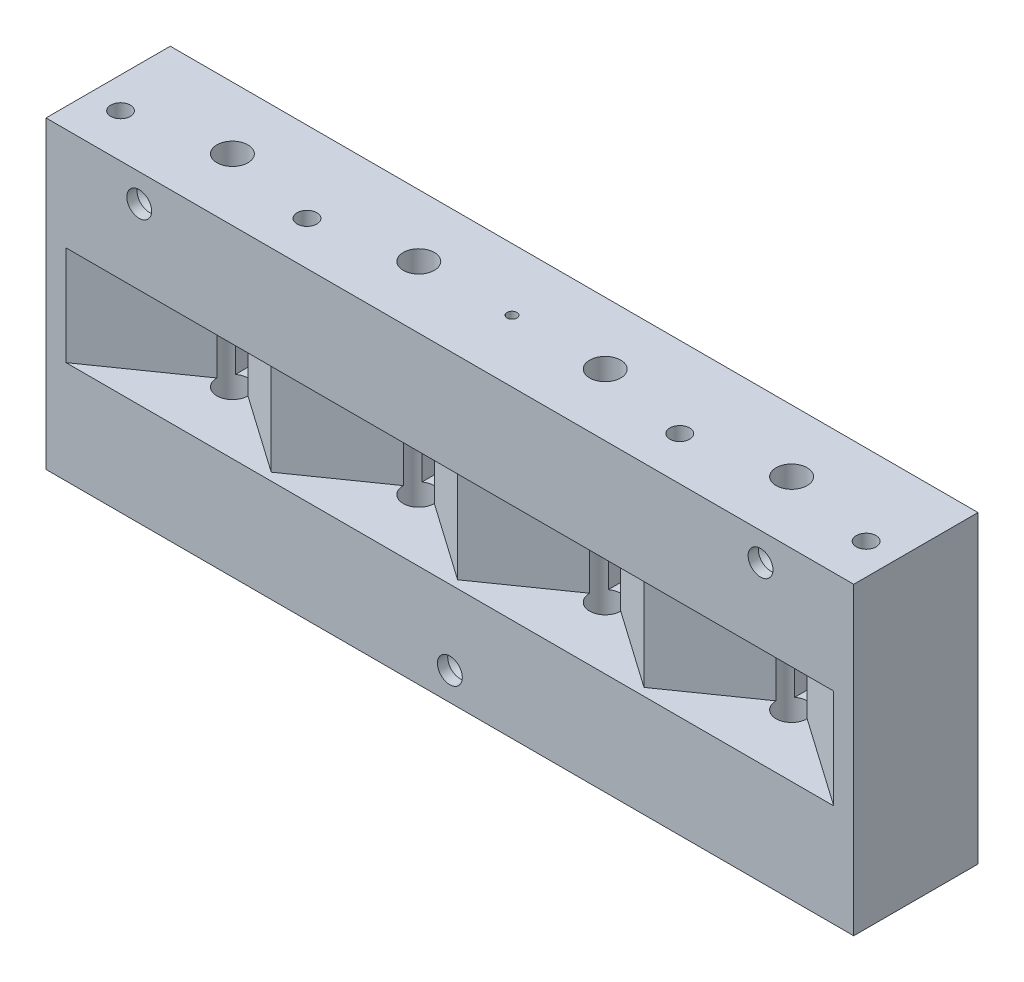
ISO-10303-21;
HEADER;
FILE_DESCRIPTION(('STEP AP214'),'2;1');
FILE_NAME('part.step','',(''),(''),'','','');
FILE_SCHEMA(('AUTOMOTIVE_DESIGN { 1 0 10303 214 1 1 1 1 }'));
ENDSEC;
DATA;
#1=APPLICATION_CONTEXT('core data for automotive mechanical design processes');
#2=APPLICATION_PROTOCOL_DEFINITION('international standard','automotive_design',2000,#1);
#3=PRODUCT_CONTEXT('',#1,'mechanical');
#4=PRODUCT('Part','Part','',(#3));
#5=PRODUCT_RELATED_PRODUCT_CATEGORY('part','',(#4));
#6=PRODUCT_DEFINITION_FORMATION('','',#4);
#7=PRODUCT_DEFINITION_CONTEXT('part definition',#1,'design');
#8=PRODUCT_DEFINITION('design','',#6,#7);
#9=PRODUCT_DEFINITION_SHAPE('','',#8);
#10=(LENGTH_UNIT() NAMED_UNIT(*) SI_UNIT(.MILLI.,.METRE.));
#11=(NAMED_UNIT(*) PLANE_ANGLE_UNIT() SI_UNIT($,.RADIAN.));
#12=(NAMED_UNIT(*) SI_UNIT($,.STERADIAN.) SOLID_ANGLE_UNIT());
#13=UNCERTAINTY_MEASURE_WITH_UNIT(LENGTH_MEASURE(1.E-05),#10,'distance_accuracy_value','');
#14=(GEOMETRIC_REPRESENTATION_CONTEXT(3) GLOBAL_UNCERTAINTY_ASSIGNED_CONTEXT((#13)) GLOBAL_UNIT_ASSIGNED_CONTEXT((#10,
#11,#12)) REPRESENTATION_CONTEXT('',''));
#15=CARTESIAN_POINT('',(0.,0.,0.));
#16=DIRECTION('',(0.,0.,1.));
#17=DIRECTION('',(1.,0.,0.));
#18=AXIS2_PLACEMENT_3D('',#15,#16,#17);
#19=CARTESIAN_POINT('',(0.,0.,-20.));
#20=DIRECTION('',(0.,0.,1.));
#21=DIRECTION('',(1.,0.,0.));
#22=AXIS2_PLACEMENT_3D('',#19,#20,#21);
#23=PLANE('',#22);
#24=CARTESIAN_POINT('',(0.,-20.,-20.));
#25=DIRECTION('',(0.,0.,1.));
#26=DIRECTION('',(1.,0.,0.));
#27=AXIS2_PLACEMENT_3D('',#24,#25,#26);
#28=CIRCLE('',#27,3.5);
#29=CARTESIAN_POINT('',(3.5,-20.,-20.));
#30=VERTEX_POINT('',#29);
#31=EDGE_CURVE('E1699',#30,#30,#28,.T.);
#32=ORIENTED_EDGE('',*,*,#31,.T.);
#33=EDGE_LOOP('',(#32));
#34=FACE_BOUND('',#33,.T.);
#35=CARTESIAN_POINT('',(46.,20.,-20.));
#36=DIRECTION('',(0.,0.,1.));
#37=DIRECTION('',(1.,0.,0.));
#38=AXIS2_PLACEMENT_3D('',#35,#36,#37);
#39=CIRCLE('',#38,3.49012806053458);
#40=CARTESIAN_POINT('',(46.,23.4901280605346,-20.));
#41=VERTEX_POINT('',#40);
#42=CARTESIAN_POINT('',(46.,16.5098719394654,-20.));
#43=VERTEX_POINT('',#42);
#44=EDGE_CURVE('E1693',#41,#43,#39,.T.);
#45=ORIENTED_EDGE('',*,*,#44,.T.);
#46=DIRECTION('',(1.,0.,0.));
#47=VECTOR('',#46,1.);
#48=CARTESIAN_POINT('',(46.,16.5098719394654,-20.));
#49=LINE('',#48,#47);
#50=CARTESIAN_POINT('',(54.,16.5098719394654,-20.));
#51=VERTEX_POINT('',#50);
#52=EDGE_CURVE('E1653',#43,#51,#49,.T.);
#53=ORIENTED_EDGE('',*,*,#52,.T.);
#54=CARTESIAN_POINT('',(54.,20.,-20.));
#55=DIRECTION('',(0.,0.,-1.));
#56=DIRECTION('',(-1.,0.,0.));
#57=AXIS2_PLACEMENT_3D('',#54,#55,#56);
#58=CIRCLE('',#57,3.49012806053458);
#59=CARTESIAN_POINT('',(54.,23.4901280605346,-20.));
#60=VERTEX_POINT('',#59);
#61=EDGE_CURVE('E1686',#60,#51,#58,.T.);
#62=ORIENTED_EDGE('',*,*,#61,.F.);
#63=DIRECTION('',(1.,0.,0.));
#64=VECTOR('',#63,1.);
#65=CARTESIAN_POINT('',(46.,23.4901280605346,-20.));
#66=LINE('',#65,#64);
#67=EDGE_CURVE('E1656',#41,#60,#66,.T.);
#68=ORIENTED_EDGE('',*,*,#67,.F.);
#69=EDGE_LOOP('',(#45,#53,#62,#68));
#70=FACE_BOUND('',#69,.T.);
#71=DIRECTION('',(0.,1.,0.));
#72=VECTOR('',#71,1.);
#73=CARTESIAN_POINT('',(-43.5,0.,-20.));
#74=LINE('',#73,#72);
#75=CARTESIAN_POINT('',(-43.5,7.99999999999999,-20.));
#76=VERTEX_POINT('',#75);
#77=CARTESIAN_POINT('',(-43.5,-8.00000000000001,-20.));
#78=VERTEX_POINT('',#77);
#79=EDGE_CURVE('E1382',#76,#78,#74,.F.);
#80=ORIENTED_EDGE('',*,*,#79,.F.);
#81=DIRECTION('',(1.,0.,0.));
#82=VECTOR('',#81,1.);
#83=CARTESIAN_POINT('',(0.,7.99999999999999,-20.));
#84=LINE('',#83,#82);
#85=CARTESIAN_POINT('',(-46.5,7.99999999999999,-20.));
#86=VERTEX_POINT('',#85);
#87=EDGE_CURVE('E1387',#86,#76,#84,.T.);
#88=ORIENTED_EDGE('',*,*,#87,.F.);
#89=DIRECTION('',(0.,1.,0.));
#90=VECTOR('',#89,1.);
#91=CARTESIAN_POINT('',(-46.5,0.,-20.));
#92=LINE('',#91,#90);
#93=CARTESIAN_POINT('',(-46.5,-8.00000000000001,-20.));
#94=VERTEX_POINT('',#93);
#95=EDGE_CURVE('E1228',#94,#86,#92,.T.);
#96=ORIENTED_EDGE('',*,*,#95,.F.);
#97=DIRECTION('',(1.,0.,0.));
#98=VECTOR('',#97,1.);
#99=CARTESIAN_POINT('',(0.,-8.00000000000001,-20.));
#100=LINE('',#99,#98);
#101=EDGE_CURVE('E1367',#78,#94,#100,.F.);
#102=ORIENTED_EDGE('',*,*,#101,.F.);
#103=EDGE_LOOP('',(#80,#88,#96,#102));
#104=FACE_BOUND('',#103,.T.);
#105=DIRECTION('',(0.,1.,0.));
#106=VECTOR('',#105,1.);
#107=CARTESIAN_POINT('',(-13.5,0.,-20.));
#108=LINE('',#107,#106);
#109=CARTESIAN_POINT('',(-13.5,8.,-20.));
#110=VERTEX_POINT('',#109);
#111=CARTESIAN_POINT('',(-13.5,-8.,-20.));
#112=VERTEX_POINT('',#111);
#113=EDGE_CURVE('E1354',#110,#112,#108,.F.);
#114=ORIENTED_EDGE('',*,*,#113,.F.);
#115=DIRECTION('',(1.,0.,0.));
#116=VECTOR('',#115,1.);
#117=CARTESIAN_POINT('',(0.,8.,-20.));
#118=LINE('',#117,#116);
#119=CARTESIAN_POINT('',(-16.5,8.,-20.));
#120=VERTEX_POINT('',#119);
#121=EDGE_CURVE('E1359',#120,#110,#118,.T.);
#122=ORIENTED_EDGE('',*,*,#121,.F.);
#123=DIRECTION('',(0.,1.,0.));
#124=VECTOR('',#123,1.);
#125=CARTESIAN_POINT('',(-16.5,0.,-20.));
#126=LINE('',#125,#124);
#127=CARTESIAN_POINT('',(-16.5,-8.,-20.));
#128=VERTEX_POINT('',#127);
#129=EDGE_CURVE('E1364',#128,#120,#126,.T.);
#130=ORIENTED_EDGE('',*,*,#129,.F.);
#131=DIRECTION('',(1.,0.,0.));
#132=VECTOR('',#131,1.);
#133=CARTESIAN_POINT('',(0.,-8.,-20.));
#134=LINE('',#133,#132);
#135=EDGE_CURVE('E1339',#112,#128,#134,.F.);
#136=ORIENTED_EDGE('',*,*,#135,.F.);
#137=EDGE_LOOP('',(#114,#122,#130,#136));
#138=FACE_BOUND('',#137,.T.);
#139=DIRECTION('',(0.,1.,0.));
#140=VECTOR('',#139,1.);
#141=CARTESIAN_POINT('',(13.5,0.,-20.));
#142=LINE('',#141,#140);
#143=CARTESIAN_POINT('',(13.5,-7.99999999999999,-20.));
#144=VERTEX_POINT('',#143);
#145=CARTESIAN_POINT('',(13.5,8.00000000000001,-20.));
#146=VERTEX_POINT('',#145);
#147=EDGE_CURVE('E1326',#144,#146,#142,.T.);
#148=ORIENTED_EDGE('',*,*,#147,.F.);
#149=DIRECTION('',(1.,0.,0.));
#150=VECTOR('',#149,1.);
#151=CARTESIAN_POINT('',(0.,-7.99999999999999,-20.));
#152=LINE('',#151,#150);
#153=CARTESIAN_POINT('',(16.5,-7.99999999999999,-20.));
#154=VERTEX_POINT('',#153);
#155=EDGE_CURVE('E1331',#154,#144,#152,.F.);
#156=ORIENTED_EDGE('',*,*,#155,.F.);
#157=DIRECTION('',(0.,1.,0.));
#158=VECTOR('',#157,1.);
#159=CARTESIAN_POINT('',(16.5,0.,-20.));
#160=LINE('',#159,#158);
#161=CARTESIAN_POINT('',(16.5,8.00000000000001,-20.));
#162=VERTEX_POINT('',#161);
#163=EDGE_CURVE('E1336',#162,#154,#160,.F.);
#164=ORIENTED_EDGE('',*,*,#163,.F.);
#165=DIRECTION('',(1.,0.,0.));
#166=VECTOR('',#165,1.);
#167=CARTESIAN_POINT('',(0.,8.00000000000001,-20.));
#168=LINE('',#167,#166);
#169=EDGE_CURVE('E1311',#146,#162,#168,.T.);
#170=ORIENTED_EDGE('',*,*,#169,.F.);
#171=EDGE_LOOP('',(#148,#156,#164,#170));
#172=FACE_BOUND('',#171,.T.);
#173=DIRECTION('',(0.,1.,0.));
#174=VECTOR('',#173,1.);
#175=CARTESIAN_POINT('',(46.5,0.,-20.));
#176=LINE('',#175,#174);
#177=CARTESIAN_POINT('',(46.5,8.,-20.));
#178=VERTEX_POINT('',#177);
#179=CARTESIAN_POINT('',(46.5,-8.,-20.));
#180=VERTEX_POINT('',#179);
#181=EDGE_CURVE('E1298',#178,#180,#176,.F.);
#182=ORIENTED_EDGE('',*,*,#181,.F.);
#183=DIRECTION('',(1.,0.,0.));
#184=VECTOR('',#183,1.);
#185=CARTESIAN_POINT('',(0.,8.,-20.));
#186=LINE('',#185,#184);
#187=CARTESIAN_POINT('',(43.5,8.,-20.));
#188=VERTEX_POINT('',#187);
#189=EDGE_CURVE('E1303',#188,#178,#186,.T.);
#190=ORIENTED_EDGE('',*,*,#189,.F.);
#191=DIRECTION('',(0.,1.,0.));
#192=VECTOR('',#191,1.);
#193=CARTESIAN_POINT('',(43.5,0.,-20.));
#194=LINE('',#193,#192);
#195=CARTESIAN_POINT('',(43.5,-8.,-20.));
#196=VERTEX_POINT('',#195);
#197=EDGE_CURVE('E1308',#196,#188,#194,.T.);
#198=ORIENTED_EDGE('',*,*,#197,.F.);
#199=DIRECTION('',(1.,0.,0.));
#200=VECTOR('',#199,1.);
#201=CARTESIAN_POINT('',(0.,-8.,-20.));
#202=LINE('',#201,#200);
#203=EDGE_CURVE('E1224',#180,#196,#202,.F.);
#204=ORIENTED_EDGE('',*,*,#203,.F.);
#205=EDGE_LOOP('',(#182,#190,#198,#204));
#206=FACE_BOUND('',#205,.T.);
#207=DIRECTION('',(1.,0.,0.));
#208=VECTOR('',#207,1.);
#209=CARTESIAN_POINT('',(0.,24.5,-20.));
#210=LINE('',#209,#208);
#211=CARTESIAN_POINT('',(65.,24.5,-20.));
#212=VERTEX_POINT('',#211);
#213=CARTESIAN_POINT('',(-65.,24.5,-20.));
#214=VERTEX_POINT('',#213);
#215=EDGE_CURVE('E42',#212,#214,#210,.F.);
#216=ORIENTED_EDGE('',*,*,#215,.F.);
#217=DIRECTION('',(0.,1.,0.));
#218=VECTOR('',#217,1.);
#219=CARTESIAN_POINT('',(65.,0.,-20.));
#220=LINE('',#219,#218);
#221=CARTESIAN_POINT('',(65.,-24.5,-20.));
#222=VERTEX_POINT('',#221);
#223=EDGE_CURVE('E1218',#222,#212,#220,.T.);
#224=ORIENTED_EDGE('',*,*,#223,.F.);
#225=DIRECTION('',(1.,0.,0.));
#226=VECTOR('',#225,1.);
#227=CARTESIAN_POINT('',(0.,-24.5,-20.));
#228=LINE('',#227,#226);
#229=CARTESIAN_POINT('',(-65.,-24.5,-20.));
#230=VERTEX_POINT('',#229);
#231=EDGE_CURVE('E1221',#230,#222,#228,.T.);
#232=ORIENTED_EDGE('',*,*,#231,.F.);
#233=DIRECTION('',(0.,1.,0.));
#234=VECTOR('',#233,1.);
#235=CARTESIAN_POINT('',(-65.,0.,-20.));
#236=LINE('',#235,#234);
#237=EDGE_CURVE('E11',#214,#230,#236,.F.);
#238=ORIENTED_EDGE('',*,*,#237,.F.);
#239=EDGE_LOOP('',(#216,#224,#232,#238));
#240=FACE_BOUND('',#239,.T.);
#241=CARTESIAN_POINT('',(-50.,20.,-20.));
#242=DIRECTION('',(0.,0.,1.));
#243=DIRECTION('',(1.,0.,0.));
#244=AXIS2_PLACEMENT_3D('',#241,#242,#243);
#245=CIRCLE('',#244,3.49012806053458);
#246=CARTESIAN_POINT('',(-46.5098719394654,20.,-20.));
#247=VERTEX_POINT('',#246);
#248=EDGE_CURVE('E36',#247,#247,#245,.T.);
#249=ORIENTED_EDGE('',*,*,#248,.T.);
#250=EDGE_LOOP('',(#249));
#251=FACE_BOUND('',#250,.T.);
#252=ADVANCED_FACE('F32',(#34,#70,#104,#138,#172,#206,#240,#251),#23,.F.);
#253=CARTESIAN_POINT('',(60.,2.2,-13.));
#254=DIRECTION('',(0.,-1.,0.));
#255=DIRECTION('',(1.,0.,0.));
#256=AXIS2_PLACEMENT_3D('',#253,#254,#255);
#257=PLANE('',#256);
#258=CARTESIAN_POINT('',(60.,2.2,-13.));
#259=DIRECTION('',(0.,-1.,0.));
#260=DIRECTION('',(1.,0.,0.));
#261=AXIS2_PLACEMENT_3D('',#258,#259,#260);
#262=CIRCLE('',#261,1.5875);
#263=CARTESIAN_POINT('',(61.5875,2.2,-13.));
#264=VERTEX_POINT('',#263);
#265=EDGE_CURVE('E451',#264,#264,#262,.T.);
#266=ORIENTED_EDGE('',*,*,#265,.T.);
#267=EDGE_LOOP('',(#266));
#268=FACE_BOUND('',#267,.T.);
#269=ADVANCED_FACE('F34',(#268),#257,.T.);
#270=CARTESIAN_POINT('',(30.,2.2,-13.));
#271=DIRECTION('',(0.,-1.,0.));
#272=DIRECTION('',(1.,0.,0.));
#273=AXIS2_PLACEMENT_3D('',#270,#271,#272);
#274=PLANE('',#273);
#275=CARTESIAN_POINT('',(30.,2.2,-13.));
#276=DIRECTION('',(0.,-1.,0.));
#277=DIRECTION('',(1.,0.,0.));
#278=AXIS2_PLACEMENT_3D('',#275,#276,#277);
#279=CIRCLE('',#278,1.5875);
#280=CARTESIAN_POINT('',(31.5875,2.2,-13.));
#281=VERTEX_POINT('',#280);
#282=EDGE_CURVE('E449',#281,#281,#279,.T.);
#283=ORIENTED_EDGE('',*,*,#282,.T.);
#284=EDGE_LOOP('',(#283));
#285=FACE_BOUND('',#284,.T.);
#286=ADVANCED_FACE('F597',(#285),#274,.T.);
#287=CARTESIAN_POINT('',(-60.,2.19999999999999,-13.));
#288=DIRECTION('',(0.,-1.,0.));
#289=DIRECTION('',(1.,0.,0.));
#290=AXIS2_PLACEMENT_3D('',#287,#288,#289);
#291=PLANE('',#290);
#292=CARTESIAN_POINT('',(-60.,2.19999999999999,-13.));
#293=DIRECTION('',(0.,-1.,0.));
#294=DIRECTION('',(1.,0.,0.));
#295=AXIS2_PLACEMENT_3D('',#292,#293,#294);
#296=CIRCLE('',#295,1.5875);
#297=CARTESIAN_POINT('',(-58.4125,2.19999999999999,-13.));
#298=VERTEX_POINT('',#297);
#299=EDGE_CURVE('E446',#298,#298,#296,.T.);
#300=ORIENTED_EDGE('',*,*,#299,.T.);
#301=EDGE_LOOP('',(#300));
#302=FACE_BOUND('',#301,.T.);
#303=ADVANCED_FACE('F1466',(#302),#291,.T.);
#304=CARTESIAN_POINT('',(-30.,2.19999999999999,-13.));
#305=DIRECTION('',(0.,-1.,0.));
#306=DIRECTION('',(1.,0.,0.));
#307=AXIS2_PLACEMENT_3D('',#304,#305,#306);
#308=PLANE('',#307);
#309=CARTESIAN_POINT('',(-30.,2.19999999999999,-13.));
#310=DIRECTION('',(0.,-1.,0.));
#311=DIRECTION('',(1.,0.,0.));
#312=AXIS2_PLACEMENT_3D('',#309,#310,#311);
#313=CIRCLE('',#312,1.58750000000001);
#314=CARTESIAN_POINT('',(-28.4125,2.19999999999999,-13.));
#315=VERTEX_POINT('',#314);
#316=EDGE_CURVE('E271',#315,#315,#313,.T.);
#317=ORIENTED_EDGE('',*,*,#316,.T.);
#318=EDGE_LOOP('',(#317));
#319=FACE_BOUND('',#318,.T.);
#320=ADVANCED_FACE('F1457',(#319),#308,.T.);
#321=CARTESIAN_POINT('',(0.,0.,-10.));
#322=DIRECTION('',(0.,1.,0.));
#323=DIRECTION('',(-1.,0.,0.));
#324=AXIS2_PLACEMENT_3D('',#321,#322,#323);
#325=PLANE('',#324);
#326=CARTESIAN_POINT('',(0.,0.,-10.));
#327=DIRECTION('',(0.,1.,0.));
#328=DIRECTION('',(-1.,0.,0.));
#329=AXIS2_PLACEMENT_3D('',#326,#327,#328);
#330=CIRCLE('',#329,0.79375);
#331=CARTESIAN_POINT('',(-0.79375,0.,-10.));
#332=VERTEX_POINT('',#331);
#333=EDGE_CURVE('E434',#332,#332,#330,.T.);
#334=ORIENTED_EDGE('',*,*,#333,.T.);
#335=EDGE_LOOP('',(#334));
#336=FACE_BOUND('',#335,.T.);
#337=ADVANCED_FACE('F1454',(#336),#325,.T.);
#338=CARTESIAN_POINT('',(60.,-2.19999999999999,-7.));
#339=DIRECTION('',(0.,1.,0.));
#340=DIRECTION('',(-1.,0.,0.));
#341=AXIS2_PLACEMENT_3D('',#338,#339,#340);
#342=PLANE('',#341);
#343=CARTESIAN_POINT('',(60.,-2.19999999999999,-7.));
#344=DIRECTION('',(0.,1.,0.));
#345=DIRECTION('',(-1.,0.,0.));
#346=AXIS2_PLACEMENT_3D('',#343,#344,#345);
#347=CIRCLE('',#346,1.5875);
#348=CARTESIAN_POINT('',(58.4125,-2.19999999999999,-7.));
#349=VERTEX_POINT('',#348);
#350=EDGE_CURVE('E431',#349,#349,#347,.T.);
#351=ORIENTED_EDGE('',*,*,#350,.T.);
#352=EDGE_LOOP('',(#351));
#353=FACE_BOUND('',#352,.T.);
#354=ADVANCED_FACE('F1456',(#353),#342,.T.);
#355=CARTESIAN_POINT('',(30.,-2.19999999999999,-7.));
#356=DIRECTION('',(0.,1.,0.));
#357=DIRECTION('',(-1.,0.,0.));
#358=AXIS2_PLACEMENT_3D('',#355,#356,#357);
#359=PLANE('',#358);
#360=CARTESIAN_POINT('',(30.,-2.19999999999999,-7.));
#361=DIRECTION('',(0.,1.,0.));
#362=DIRECTION('',(-1.,0.,0.));
#363=AXIS2_PLACEMENT_3D('',#360,#361,#362);
#364=CIRCLE('',#363,1.58750000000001);
#365=CARTESIAN_POINT('',(28.4125,-2.19999999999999,-7.));
#366=VERTEX_POINT('',#365);
#367=EDGE_CURVE('E428',#366,#366,#364,.T.);
#368=ORIENTED_EDGE('',*,*,#367,.T.);
#369=EDGE_LOOP('',(#368));
#370=FACE_BOUND('',#369,.T.);
#371=ADVANCED_FACE('F1463',(#370),#359,.T.);
#372=CARTESIAN_POINT('',(-60.,-2.2,-7.));
#373=DIRECTION('',(0.,1.,0.));
#374=DIRECTION('',(-1.,0.,0.));
#375=AXIS2_PLACEMENT_3D('',#372,#373,#374);
#376=PLANE('',#375);
#377=CARTESIAN_POINT('',(-60.,-2.2,-7.));
#378=DIRECTION('',(0.,1.,0.));
#379=DIRECTION('',(-1.,0.,0.));
#380=AXIS2_PLACEMENT_3D('',#377,#378,#379);
#381=CIRCLE('',#380,1.58186477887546);
#382=CARTESIAN_POINT('',(-61.5818647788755,-2.2,-7.));
#383=VERTEX_POINT('',#382);
#384=EDGE_CURVE('E425',#383,#383,#381,.T.);
#385=ORIENTED_EDGE('',*,*,#384,.T.);
#386=EDGE_LOOP('',(#385));
#387=FACE_BOUND('',#386,.T.);
#388=ADVANCED_FACE('F1510',(#387),#376,.T.);
#389=CARTESIAN_POINT('',(-30.,-2.2,-7.));
#390=DIRECTION('',(0.,1.,0.));
#391=DIRECTION('',(-1.,0.,0.));
#392=AXIS2_PLACEMENT_3D('',#389,#390,#391);
#393=PLANE('',#392);
#394=CARTESIAN_POINT('',(-30.,-2.2,-7.));
#395=DIRECTION('',(0.,1.,0.));
#396=DIRECTION('',(-1.,0.,0.));
#397=AXIS2_PLACEMENT_3D('',#394,#395,#396);
#398=CIRCLE('',#397,1.5875);
#399=CARTESIAN_POINT('',(-31.5875,-2.2,-7.));
#400=VERTEX_POINT('',#399);
#401=EDGE_CURVE('E422',#400,#400,#398,.T.);
#402=ORIENTED_EDGE('',*,*,#401,.T.);
#403=EDGE_LOOP('',(#402));
#404=FACE_BOUND('',#403,.T.);
#405=ADVANCED_FACE('F1519',(#404),#393,.T.);
#406=CARTESIAN_POINT('',(42.5,-8.,-10.));
#407=DIRECTION('',(-0.573576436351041,0.,-0.819152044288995));
#408=DIRECTION('',(-0.819152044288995,0.,0.573576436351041));
#409=AXIS2_PLACEMENT_3D('',#406,#407,#408);
#410=PLANE('',#409);
#411=DIRECTION('',(0.,1.,0.));
#412=VECTOR('',#411,1.);
#413=CARTESIAN_POINT('',(42.5,-24.5,-10.));
#414=LINE('',#413,#412);
#415=CARTESIAN_POINT('',(42.5,-8.,-10.));
#416=VERTEX_POINT('',#415);
#417=CARTESIAN_POINT('',(42.5,8.,-10.));
#418=VERTEX_POINT('',#417);
#419=EDGE_CURVE('E269',#416,#418,#414,.T.);
#420=ORIENTED_EDGE('',*,*,#419,.T.);
#421=DIRECTION('',(-0.819152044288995,0.,0.573576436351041));
#422=VECTOR('',#421,1.);
#423=CARTESIAN_POINT('',(42.5,8.,-10.));
#424=LINE('',#423,#422);
#425=CARTESIAN_POINT('',(29.9999999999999,8.,-1.24740577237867));
#426=VERTEX_POINT('',#425);
#427=EDGE_CURVE('E482',#418,#426,#424,.T.);
#428=ORIENTED_EDGE('',*,*,#427,.T.);
#429=DIRECTION('',(0.,1.,0.));
#430=VECTOR('',#429,1.);
#431=CARTESIAN_POINT('',(29.9999999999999,-8.,-1.24740577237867));
#432=LINE('',#431,#430);
#433=CARTESIAN_POINT('',(29.9999999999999,-8.,-1.24740577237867));
#434=VERTEX_POINT('',#433);
#435=EDGE_CURVE('E288',#426,#434,#432,.F.);
#436=ORIENTED_EDGE('',*,*,#435,.T.);
#437=DIRECTION('',(-0.819152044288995,0.,0.573576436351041));
#438=VECTOR('',#437,1.);
#439=CARTESIAN_POINT('',(42.5,-8.,-10.));
#440=LINE('',#439,#438);
#441=EDGE_CURVE('E259',#416,#434,#440,.T.);
#442=ORIENTED_EDGE('',*,*,#441,.F.);
#443=EDGE_LOOP('',(#420,#428,#436,#442));
#444=FACE_BOUND('',#443,.T.);
#445=ADVANCED_FACE('F580',(#444),#410,.F.);
#446=CARTESIAN_POINT('',(12.5,-8.,-10.));
#447=DIRECTION('',(-0.573576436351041,0.,-0.819152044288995));
#448=DIRECTION('',(-0.819152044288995,0.,0.573576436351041));
#449=AXIS2_PLACEMENT_3D('',#446,#447,#448);
#450=PLANE('',#449);
#451=DIRECTION('',(0.,1.,0.));
#452=VECTOR('',#451,1.);
#453=CARTESIAN_POINT('',(12.5,-24.5,-10.));
#454=LINE('',#453,#452);
#455=CARTESIAN_POINT('',(12.5,-8.00000000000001,-10.));
#456=VERTEX_POINT('',#455);
#457=CARTESIAN_POINT('',(12.5,8.,-10.));
#458=VERTEX_POINT('',#457);
#459=EDGE_CURVE('E279',#456,#458,#454,.T.);
#460=ORIENTED_EDGE('',*,*,#459,.T.);
#461=DIRECTION('',(-0.819152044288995,0.,0.573576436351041));
#462=VECTOR('',#461,1.);
#463=CARTESIAN_POINT('',(12.5,8.,-10.));
#464=LINE('',#463,#462);
#465=CARTESIAN_POINT('',(0.,7.99999999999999,-1.24740577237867));
#466=VERTEX_POINT('',#465);
#467=EDGE_CURVE('E473',#458,#466,#464,.T.);
#468=ORIENTED_EDGE('',*,*,#467,.T.);
#469=DIRECTION('',(0.,1.,0.));
#470=VECTOR('',#469,1.);
#471=CARTESIAN_POINT('',(0.,-8.00000000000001,-1.24740577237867));
#472=LINE('',#471,#470);
#473=CARTESIAN_POINT('',(0.,-8.00000000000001,-1.24740577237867));
#474=VERTEX_POINT('',#473);
#475=EDGE_CURVE('E260',#466,#474,#472,.F.);
#476=ORIENTED_EDGE('',*,*,#475,.T.);
#477=DIRECTION('',(-0.819152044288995,0.,0.573576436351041));
#478=VECTOR('',#477,1.);
#479=CARTESIAN_POINT('',(12.5,-8.,-9.99999999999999));
#480=LINE('',#479,#478);
#481=EDGE_CURVE('E509',#456,#474,#480,.T.);
#482=ORIENTED_EDGE('',*,*,#481,.F.);
#483=EDGE_LOOP('',(#460,#468,#476,#482));
#484=FACE_BOUND('',#483,.T.);
#485=ADVANCED_FACE('F540',(#484),#450,.F.);
#486=CARTESIAN_POINT('',(17.5,-8.,-10.));
#487=DIRECTION('',(0.573576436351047,0.,-0.819152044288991));
#488=DIRECTION('',(-0.819152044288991,0.,-0.573576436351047));
#489=AXIS2_PLACEMENT_3D('',#486,#487,#488);
#490=PLANE('',#489);
#491=DIRECTION('',(-0.819152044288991,0.,-0.573576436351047));
#492=VECTOR('',#491,1.);
#493=CARTESIAN_POINT('',(29.9999999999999,8.,-1.24740577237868));
#494=LINE('',#493,#492);
#495=CARTESIAN_POINT('',(17.5,8.,-10.));
#496=VERTEX_POINT('',#495);
#497=EDGE_CURVE('E478',#426,#496,#494,.T.);
#498=ORIENTED_EDGE('',*,*,#497,.T.);
#499=DIRECTION('',(0.,1.,0.));
#500=VECTOR('',#499,1.);
#501=CARTESIAN_POINT('',(17.5,-24.5,-10.));
#502=LINE('',#501,#500);
#503=CARTESIAN_POINT('',(17.5,-8.,-10.));
#504=VERTEX_POINT('',#503);
#505=EDGE_CURVE('E419',#496,#504,#502,.F.);
#506=ORIENTED_EDGE('',*,*,#505,.T.);
#507=DIRECTION('',(-0.819152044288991,0.,-0.573576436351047));
#508=VECTOR('',#507,1.);
#509=CARTESIAN_POINT('',(29.9999999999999,-8.,-1.24740577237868));
#510=LINE('',#509,#508);
#511=EDGE_CURVE('E513',#434,#504,#510,.T.);
#512=ORIENTED_EDGE('',*,*,#511,.F.);
#513=ORIENTED_EDGE('',*,*,#435,.F.);
#514=EDGE_LOOP('',(#498,#506,#512,#513));
#515=FACE_BOUND('',#514,.T.);
#516=ADVANCED_FACE('F581',(#515),#490,.F.);
#517=CARTESIAN_POINT('',(-42.5,-8.00000000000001,-10.));
#518=DIRECTION('',(0.573576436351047,0.,-0.819152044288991));
#519=DIRECTION('',(-0.819152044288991,0.,-0.573576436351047));
#520=AXIS2_PLACEMENT_3D('',#517,#518,#519);
#521=PLANE('',#520);
#522=DIRECTION('',(0.,1.,0.));
#523=VECTOR('',#522,1.);
#524=CARTESIAN_POINT('',(-30.0000000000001,-8.00000000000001,-1.24740577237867));
#525=LINE('',#524,#523);
#526=CARTESIAN_POINT('',(-30.0000000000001,-8.00000000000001,-1.24740577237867));
#527=VERTEX_POINT('',#526);
#528=CARTESIAN_POINT('',(-30.0000000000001,7.99999999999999,-1.24740577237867));
#529=VERTEX_POINT('',#528);
#530=EDGE_CURVE('E286',#527,#529,#525,.T.);
#531=ORIENTED_EDGE('',*,*,#530,.T.);
#532=DIRECTION('',(-0.819152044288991,0.,-0.573576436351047));
#533=VECTOR('',#532,1.);
#534=CARTESIAN_POINT('',(-30.0000000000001,7.99999999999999,-1.24740577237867));
#535=LINE('',#534,#533);
#536=CARTESIAN_POINT('',(-42.5,7.99999999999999,-9.99999999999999));
#537=VERTEX_POINT('',#536);
#538=EDGE_CURVE('E453',#529,#537,#535,.T.);
#539=ORIENTED_EDGE('',*,*,#538,.T.);
#540=DIRECTION('',(0.,1.,0.));
#541=VECTOR('',#540,1.);
#542=CARTESIAN_POINT('',(-42.5,-24.5,-10.));
#543=LINE('',#542,#541);
#544=CARTESIAN_POINT('',(-42.5,-8.00000000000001,-9.99999999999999));
#545=VERTEX_POINT('',#544);
#546=EDGE_CURVE('E415',#537,#545,#543,.F.);
#547=ORIENTED_EDGE('',*,*,#546,.T.);
#548=DIRECTION('',(-0.819152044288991,0.,-0.573576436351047));
#549=VECTOR('',#548,1.);
#550=CARTESIAN_POINT('',(-30.0000000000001,-8.00000000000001,-1.24740577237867));
#551=LINE('',#550,#549);
#552=EDGE_CURVE('E498',#527,#545,#551,.T.);
#553=ORIENTED_EDGE('',*,*,#552,.F.);
#554=EDGE_LOOP('',(#531,#539,#547,#553));
#555=FACE_BOUND('',#554,.T.);
#556=ADVANCED_FACE('F564',(#555),#521,.F.);
#557=CARTESIAN_POINT('',(-17.5,-8.00000000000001,-10.));
#558=DIRECTION('',(-0.573576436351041,0.,-0.819152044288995));
#559=DIRECTION('',(-0.819152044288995,0.,0.573576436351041));
#560=AXIS2_PLACEMENT_3D('',#557,#558,#559);
#561=PLANE('',#560);
#562=DIRECTION('',(0.,1.,0.));
#563=VECTOR('',#562,1.);
#564=CARTESIAN_POINT('',(-17.5,-24.5,-10.));
#565=LINE('',#564,#563);
#566=CARTESIAN_POINT('',(-17.5,-8.00000000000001,-10.));
#567=VERTEX_POINT('',#566);
#568=CARTESIAN_POINT('',(-17.5,7.99999999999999,-10.));
#569=VERTEX_POINT('',#568);
#570=EDGE_CURVE('E414',#567,#569,#565,.T.);
#571=ORIENTED_EDGE('',*,*,#570,.T.);
#572=DIRECTION('',(-0.819152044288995,0.,0.573576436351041));
#573=VECTOR('',#572,1.);
#574=CARTESIAN_POINT('',(-17.5,7.99999999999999,-10.));
#575=LINE('',#574,#573);
#576=EDGE_CURVE('E456',#569,#529,#575,.T.);
#577=ORIENTED_EDGE('',*,*,#576,.T.);
#578=ORIENTED_EDGE('',*,*,#530,.F.);
#579=DIRECTION('',(-0.819152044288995,0.,0.573576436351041));
#580=VECTOR('',#579,1.);
#581=CARTESIAN_POINT('',(-17.5,-8.00000000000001,-10.));
#582=LINE('',#581,#580);
#583=EDGE_CURVE('E500',#567,#527,#582,.T.);
#584=ORIENTED_EDGE('',*,*,#583,.F.);
#585=EDGE_LOOP('',(#571,#577,#578,#584));
#586=FACE_BOUND('',#585,.T.);
#587=ADVANCED_FACE('F561',(#586),#561,.F.);
#588=CARTESIAN_POINT('',(-12.5,-8.00000000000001,-10.));
#589=DIRECTION('',(0.573576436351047,0.,-0.819152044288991));
#590=DIRECTION('',(-0.819152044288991,0.,-0.573576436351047));
#591=AXIS2_PLACEMENT_3D('',#588,#589,#590);
#592=PLANE('',#591);
#593=DIRECTION('',(-0.819152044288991,0.,-0.573576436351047));
#594=VECTOR('',#593,1.);
#595=CARTESIAN_POINT('',(0.,7.99999999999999,-1.24740577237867));
#596=LINE('',#595,#594);
#597=CARTESIAN_POINT('',(-12.5,7.99999999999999,-10.));
#598=VERTEX_POINT('',#597);
#599=EDGE_CURVE('E462',#466,#598,#596,.T.);
#600=ORIENTED_EDGE('',*,*,#599,.T.);
#601=DIRECTION('',(0.,1.,0.));
#602=VECTOR('',#601,1.);
#603=CARTESIAN_POINT('',(-12.5,-24.5,-10.));
#604=LINE('',#603,#602);
#605=CARTESIAN_POINT('',(-12.5,-8.00000000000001,-10.));
#606=VERTEX_POINT('',#605);
#607=EDGE_CURVE('E308',#598,#606,#604,.F.);
#608=ORIENTED_EDGE('',*,*,#607,.T.);
#609=DIRECTION('',(-0.819152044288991,0.,-0.573576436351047));
#610=VECTOR('',#609,1.);
#611=CARTESIAN_POINT('',(0.,-8.00000000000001,-1.24740577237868));
#612=LINE('',#611,#610);
#613=EDGE_CURVE('E505',#474,#606,#612,.T.);
#614=ORIENTED_EDGE('',*,*,#613,.F.);
#615=ORIENTED_EDGE('',*,*,#475,.F.);
#616=EDGE_LOOP('',(#600,#608,#614,#615));
#617=FACE_BOUND('',#616,.T.);
#618=ADVANCED_FACE('F553',(#617),#592,.F.);
#619=CARTESIAN_POINT('',(47.5,-8.,-10.));
#620=DIRECTION('',(0.573576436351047,0.,-0.819152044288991));
#621=DIRECTION('',(-0.819152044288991,0.,-0.573576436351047));
#622=AXIS2_PLACEMENT_3D('',#619,#620,#621);
#623=PLANE('',#622);
#624=DIRECTION('',(0.,1.,0.));
#625=VECTOR('',#624,1.);
#626=CARTESIAN_POINT('',(47.5,-24.5,-10.));
#627=LINE('',#626,#625);
#628=CARTESIAN_POINT('',(47.5,8.,-9.99999999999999));
#629=VERTEX_POINT('',#628);
#630=CARTESIAN_POINT('',(47.5,-8.,-9.99999999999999));
#631=VERTEX_POINT('',#630);
#632=EDGE_CURVE('E267',#629,#631,#627,.F.);
#633=ORIENTED_EDGE('',*,*,#632,.T.);
#634=DIRECTION('',(-0.819152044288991,0.,-0.573576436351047));
#635=VECTOR('',#634,1.);
#636=CARTESIAN_POINT('',(61.7814800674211,-8.,0.));
#637=LINE('',#636,#635);
#638=CARTESIAN_POINT('',(61.7814800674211,-8.,0.));
#639=VERTEX_POINT('',#638);
#640=EDGE_CURVE('E248',#639,#631,#637,.T.);
#641=ORIENTED_EDGE('',*,*,#640,.F.);
#642=DIRECTION('',(0.,1.,0.));
#643=VECTOR('',#642,1.);
#644=CARTESIAN_POINT('',(61.7814800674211,0.,0.));
#645=LINE('',#644,#643);
#646=CARTESIAN_POINT('',(61.7814800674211,8.,0.));
#647=VERTEX_POINT('',#646);
#648=EDGE_CURVE('E306',#647,#639,#645,.F.);
#649=ORIENTED_EDGE('',*,*,#648,.F.);
#650=DIRECTION('',(-0.819152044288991,0.,-0.573576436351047));
#651=VECTOR('',#650,1.);
#652=CARTESIAN_POINT('',(61.7814800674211,8.,0.));
#653=LINE('',#652,#651);
#654=EDGE_CURVE('E274',#647,#629,#653,.T.);
#655=ORIENTED_EDGE('',*,*,#654,.T.);
#656=EDGE_LOOP('',(#633,#641,#649,#655));
#657=FACE_BOUND('',#656,.T.);
#658=ADVANCED_FACE('F273',(#657),#623,.F.);
#659=CARTESIAN_POINT('',(-45.,-8.00000000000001,-10.));
#660=DIRECTION('',(0.,1.,0.));
#661=DIRECTION('',(-1.,0.,0.));
#662=AXIS2_PLACEMENT_3D('',#659,#660,#661);
#663=PLANE('',#662);
#664=CARTESIAN_POINT('',(-45.,-8.00000000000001,-10.));
#665=DIRECTION('',(0.,1.,0.));
#666=DIRECTION('',(-1.,0.,0.));
#667=AXIS2_PLACEMENT_3D('',#664,#665,#666);
#668=CIRCLE('',#667,2.5);
#669=CARTESIAN_POINT('',(-47.5,-8.00000000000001,-10.));
#670=VERTEX_POINT('',#669);
#671=EDGE_CURVE('E440',#545,#670,#668,.F.);
#672=ORIENTED_EDGE('',*,*,#671,.T.);
#673=DIRECTION('',(-0.819152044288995,0.,0.573576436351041));
#674=VECTOR('',#673,1.);
#675=CARTESIAN_POINT('',(-47.5,-8.00000000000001,-10.));
#676=LINE('',#675,#674);
#677=CARTESIAN_POINT('',(-61.7814800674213,-8.00000000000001,0.));
#678=VERTEX_POINT('',#677);
#679=EDGE_CURVE('E495',#670,#678,#676,.T.);
#680=ORIENTED_EDGE('',*,*,#679,.T.);
#681=DIRECTION('',(1.,0.,0.));
#682=VECTOR('',#681,1.);
#683=CARTESIAN_POINT('',(0.,-8.,0.));
#684=LINE('',#683,#682);
#685=EDGE_CURVE('E255',#639,#678,#684,.F.);
#686=ORIENTED_EDGE('',*,*,#685,.F.);
#687=ORIENTED_EDGE('',*,*,#640,.T.);
#688=CARTESIAN_POINT('',(45.,-8.,-10.));
#689=DIRECTION('',(0.,1.,0.));
#690=DIRECTION('',(-1.,0.,0.));
#691=AXIS2_PLACEMENT_3D('',#688,#689,#690);
#692=CIRCLE('',#691,2.5);
#693=EDGE_CURVE('E252',#631,#416,#692,.F.);
#694=ORIENTED_EDGE('',*,*,#693,.T.);
#695=ORIENTED_EDGE('',*,*,#441,.T.);
#696=ORIENTED_EDGE('',*,*,#511,.T.);
#697=CARTESIAN_POINT('',(15.,-8.,-10.));
#698=DIRECTION('',(0.,1.,0.));
#699=DIRECTION('',(-1.,0.,0.));
#700=AXIS2_PLACEMENT_3D('',#697,#698,#699);
#701=CIRCLE('',#700,2.5);
#702=EDGE_CURVE('E270',#504,#456,#701,.F.);
#703=ORIENTED_EDGE('',*,*,#702,.T.);
#704=ORIENTED_EDGE('',*,*,#481,.T.);
#705=ORIENTED_EDGE('',*,*,#613,.T.);
#706=CARTESIAN_POINT('',(-15.,-8.00000000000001,-10.));
#707=DIRECTION('',(0.,1.,0.));
#708=DIRECTION('',(-1.,0.,0.));
#709=AXIS2_PLACEMENT_3D('',#706,#707,#708);
#710=CIRCLE('',#709,2.5);
#711=EDGE_CURVE('E437',#606,#567,#710,.F.);
#712=ORIENTED_EDGE('',*,*,#711,.T.);
#713=ORIENTED_EDGE('',*,*,#583,.T.);
#714=ORIENTED_EDGE('',*,*,#552,.T.);
#715=EDGE_LOOP('',(#672,#680,#686,#687,#694,#695,#696,#703,#704,#705,#712,#713,#714));
#716=FACE_BOUND('',#715,.T.);
#717=ADVANCED_FACE('F251',(#716),#663,.T.);
#718=CARTESIAN_POINT('',(-47.5,-8.00000000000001,-10.));
#719=DIRECTION('',(-0.573576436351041,0.,-0.819152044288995));
#720=DIRECTION('',(-0.819152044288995,0.,0.573576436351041));
#721=AXIS2_PLACEMENT_3D('',#718,#719,#720);
#722=PLANE('',#721);
#723=DIRECTION('',(0.,1.,0.));
#724=VECTOR('',#723,1.);
#725=CARTESIAN_POINT('',(-61.7814800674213,0.,0.));
#726=LINE('',#725,#724);
#727=CARTESIAN_POINT('',(-61.7814800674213,7.99999999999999,0.));
#728=VERTEX_POINT('',#727);
#729=EDGE_CURVE('E303',#678,#728,#726,.T.);
#730=ORIENTED_EDGE('',*,*,#729,.F.);
#731=ORIENTED_EDGE('',*,*,#679,.F.);
#732=DIRECTION('',(0.,1.,0.));
#733=VECTOR('',#732,1.);
#734=CARTESIAN_POINT('',(-47.5,-24.5,-10.));
#735=LINE('',#734,#733);
#736=CARTESIAN_POINT('',(-47.5,7.99999999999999,-10.));
#737=VERTEX_POINT('',#736);
#738=EDGE_CURVE('E418',#670,#737,#735,.T.);
#739=ORIENTED_EDGE('',*,*,#738,.T.);
#740=DIRECTION('',(-0.819152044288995,0.,0.573576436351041));
#741=VECTOR('',#740,1.);
#742=CARTESIAN_POINT('',(-47.5,7.99999999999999,-10.));
#743=LINE('',#742,#741);
#744=EDGE_CURVE('E490',#737,#728,#743,.T.);
#745=ORIENTED_EDGE('',*,*,#744,.T.);
#746=EDGE_LOOP('',(#730,#731,#739,#745));
#747=FACE_BOUND('',#746,.T.);
#748=ADVANCED_FACE('F573',(#747),#722,.F.);
#749=CARTESIAN_POINT('',(-45.,7.99999999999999,-10.));
#750=DIRECTION('',(0.,1.,0.));
#751=DIRECTION('',(-1.,0.,0.));
#752=AXIS2_PLACEMENT_3D('',#749,#750,#751);
#753=PLANE('',#752);
#754=ORIENTED_EDGE('',*,*,#576,.F.);
#755=CARTESIAN_POINT('',(-15.,7.99999999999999,-10.));
#756=DIRECTION('',(0.,1.,0.));
#757=DIRECTION('',(-1.,0.,0.));
#758=AXIS2_PLACEMENT_3D('',#755,#756,#757);
#759=CIRCLE('',#758,2.5);
#760=EDGE_CURVE('E411',#569,#598,#759,.T.);
#761=ORIENTED_EDGE('',*,*,#760,.T.);
#762=ORIENTED_EDGE('',*,*,#599,.F.);
#763=ORIENTED_EDGE('',*,*,#467,.F.);
#764=CARTESIAN_POINT('',(15.,8.,-10.));
#765=DIRECTION('',(0.,1.,0.));
#766=DIRECTION('',(-1.,0.,0.));
#767=AXIS2_PLACEMENT_3D('',#764,#765,#766);
#768=CIRCLE('',#767,2.5);
#769=EDGE_CURVE('E276',#458,#496,#768,.T.);
#770=ORIENTED_EDGE('',*,*,#769,.T.);
#771=ORIENTED_EDGE('',*,*,#497,.F.);
#772=ORIENTED_EDGE('',*,*,#427,.F.);
#773=CARTESIAN_POINT('',(45.,8.,-10.));
#774=DIRECTION('',(0.,1.,0.));
#775=DIRECTION('',(-1.,0.,0.));
#776=AXIS2_PLACEMENT_3D('',#773,#774,#775);
#777=CIRCLE('',#776,2.5);
#778=EDGE_CURVE('E281',#418,#629,#777,.T.);
#779=ORIENTED_EDGE('',*,*,#778,.T.);
#780=ORIENTED_EDGE('',*,*,#654,.F.);
#781=DIRECTION('',(1.,0.,0.));
#782=VECTOR('',#781,1.);
#783=CARTESIAN_POINT('',(0.,7.99999999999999,0.));
#784=LINE('',#783,#782);
#785=EDGE_CURVE('E299',#728,#647,#784,.T.);
#786=ORIENTED_EDGE('',*,*,#785,.F.);
#787=ORIENTED_EDGE('',*,*,#744,.F.);
#788=CARTESIAN_POINT('',(-45.,7.99999999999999,-10.));
#789=DIRECTION('',(0.,1.,0.));
#790=DIRECTION('',(-1.,0.,0.));
#791=AXIS2_PLACEMENT_3D('',#788,#789,#790);
#792=CIRCLE('',#791,2.5);
#793=EDGE_CURVE('E416',#737,#537,#792,.T.);
#794=ORIENTED_EDGE('',*,*,#793,.T.);
#795=ORIENTED_EDGE('',*,*,#538,.F.);
#796=EDGE_LOOP('',(#754,#761,#762,#763,#770,#771,#772,#779,#780,#786,#787,#794,#795));
#797=FACE_BOUND('',#796,.T.);
#798=ADVANCED_FACE('F548',(#797),#753,.F.);
#799=CARTESIAN_POINT('',(60.,2.2,-13.));
#800=DIRECTION('',(0.,-1.,0.));
#801=DIRECTION('',(1.,0.,0.));
#802=AXIS2_PLACEMENT_3D('',#799,#800,#801);
#803=CYLINDRICAL_SURFACE('',#802,1.5875);
#804=CARTESIAN_POINT('',(60.,-24.5,-13.));
#805=DIRECTION('',(0.,-1.,0.));
#806=DIRECTION('',(1.,0.,0.));
#807=AXIS2_PLACEMENT_3D('',#804,#805,#806);
#808=CIRCLE('',#807,1.5875);
#809=CARTESIAN_POINT('',(61.5875,-24.5,-13.));
#810=VERTEX_POINT('',#809);
#811=EDGE_CURVE('E368',#810,#810,#808,.F.);
#812=ORIENTED_EDGE('',*,*,#811,.F.);
#813=EDGE_LOOP('',(#812));
#814=FACE_BOUND('',#813,.T.);
#815=ORIENTED_EDGE('',*,*,#265,.F.);
#816=EDGE_LOOP('',(#815));
#817=FACE_BOUND('',#816,.T.);
#818=ADVANCED_FACE('F729',(#814,#817),#803,.F.);
#819=CARTESIAN_POINT('',(30.,2.2,-13.));
#820=DIRECTION('',(0.,-1.,0.));
#821=DIRECTION('',(1.,0.,0.));
#822=AXIS2_PLACEMENT_3D('',#819,#820,#821);
#823=CYLINDRICAL_SURFACE('',#822,1.5875);
#824=CARTESIAN_POINT('',(30.,-24.5,-13.));
#825=DIRECTION('',(0.,-1.,0.));
#826=DIRECTION('',(1.,0.,0.));
#827=AXIS2_PLACEMENT_3D('',#824,#825,#826);
#828=CIRCLE('',#827,1.5875);
#829=CARTESIAN_POINT('',(31.5875,-24.5,-13.));
#830=VERTEX_POINT('',#829);
#831=EDGE_CURVE('E365',#830,#830,#828,.F.);
#832=ORIENTED_EDGE('',*,*,#831,.F.);
#833=EDGE_LOOP('',(#832));
#834=FACE_BOUND('',#833,.T.);
#835=ORIENTED_EDGE('',*,*,#282,.F.);
#836=EDGE_LOOP('',(#835));
#837=FACE_BOUND('',#836,.T.);
#838=ADVANCED_FACE('F725',(#834,#837),#823,.F.);
#839=CARTESIAN_POINT('',(-60.,2.19999999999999,-13.));
#840=DIRECTION('',(0.,-1.,0.));
#841=DIRECTION('',(1.,0.,0.));
#842=AXIS2_PLACEMENT_3D('',#839,#840,#841);
#843=CYLINDRICAL_SURFACE('',#842,1.5875);
#844=CARTESIAN_POINT('',(-60.,-24.5,-13.));
#845=DIRECTION('',(0.,-1.,0.));
#846=DIRECTION('',(1.,0.,0.));
#847=AXIS2_PLACEMENT_3D('',#844,#845,#846);
#848=CIRCLE('',#847,1.5875);
#849=CARTESIAN_POINT('',(-58.4125,-24.5,-13.));
#850=VERTEX_POINT('',#849);
#851=EDGE_CURVE('E362',#850,#850,#848,.F.);
#852=ORIENTED_EDGE('',*,*,#851,.F.);
#853=EDGE_LOOP('',(#852));
#854=FACE_BOUND('',#853,.T.);
#855=ORIENTED_EDGE('',*,*,#299,.F.);
#856=EDGE_LOOP('',(#855));
#857=FACE_BOUND('',#856,.T.);
#858=ADVANCED_FACE('F721',(#854,#857),#843,.F.);
#859=CARTESIAN_POINT('',(-30.,2.19999999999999,-13.));
#860=DIRECTION('',(0.,-1.,0.));
#861=DIRECTION('',(1.,0.,0.));
#862=AXIS2_PLACEMENT_3D('',#859,#860,#861);
#863=CYLINDRICAL_SURFACE('',#862,1.58750000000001);
#864=CARTESIAN_POINT('',(-30.,-24.5,-13.));
#865=DIRECTION('',(0.,-1.,0.));
#866=DIRECTION('',(1.,0.,0.));
#867=AXIS2_PLACEMENT_3D('',#864,#865,#866);
#868=CIRCLE('',#867,1.58750000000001);
#869=CARTESIAN_POINT('',(-28.4125,-24.5,-13.));
#870=VERTEX_POINT('',#869);
#871=EDGE_CURVE('E359',#870,#870,#868,.F.);
#872=ORIENTED_EDGE('',*,*,#871,.F.);
#873=EDGE_LOOP('',(#872));
#874=FACE_BOUND('',#873,.T.);
#875=ORIENTED_EDGE('',*,*,#316,.F.);
#876=EDGE_LOOP('',(#875));
#877=FACE_BOUND('',#876,.T.);
#878=ADVANCED_FACE('F717',(#874,#877),#863,.F.);
#879=CARTESIAN_POINT('',(0.,0.,-10.));
#880=DIRECTION('',(0.,1.,0.));
#881=DIRECTION('',(-1.,0.,0.));
#882=AXIS2_PLACEMENT_3D('',#879,#880,#881);
#883=CYLINDRICAL_SURFACE('',#882,0.79375);
#884=CARTESIAN_POINT('',(0.,24.5,-10.));
#885=DIRECTION('',(0.,1.,0.));
#886=DIRECTION('',(-1.,0.,0.));
#887=AXIS2_PLACEMENT_3D('',#884,#885,#886);
#888=CIRCLE('',#887,0.79375);
#889=CARTESIAN_POINT('',(-0.793750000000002,24.5,-10.));
#890=VERTEX_POINT('',#889);
#891=EDGE_CURVE('E342',#890,#890,#888,.F.);
#892=ORIENTED_EDGE('',*,*,#891,.F.);
#893=EDGE_LOOP('',(#892));
#894=FACE_BOUND('',#893,.T.);
#895=ORIENTED_EDGE('',*,*,#333,.F.);
#896=EDGE_LOOP('',(#895));
#897=FACE_BOUND('',#896,.T.);
#898=ADVANCED_FACE('F713',(#894,#897),#883,.F.);
#899=CARTESIAN_POINT('',(60.,-2.19999999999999,-7.));
#900=DIRECTION('',(0.,1.,0.));
#901=DIRECTION('',(-1.,0.,0.));
#902=AXIS2_PLACEMENT_3D('',#899,#900,#901);
#903=CYLINDRICAL_SURFACE('',#902,1.5875);
#904=CARTESIAN_POINT('',(60.,24.5,-7.));
#905=DIRECTION('',(0.,1.,0.));
#906=DIRECTION('',(-1.,0.,0.));
#907=AXIS2_PLACEMENT_3D('',#904,#905,#906);
#908=CIRCLE('',#907,1.5875);
#909=CARTESIAN_POINT('',(58.4125,24.5,-7.));
#910=VERTEX_POINT('',#909);
#911=EDGE_CURVE('E339',#910,#910,#908,.F.);
#912=ORIENTED_EDGE('',*,*,#911,.F.);
#913=EDGE_LOOP('',(#912));
#914=FACE_BOUND('',#913,.T.);
#915=ORIENTED_EDGE('',*,*,#350,.F.);
#916=EDGE_LOOP('',(#915));
#917=FACE_BOUND('',#916,.T.);
#918=ADVANCED_FACE('F709',(#914,#917),#903,.F.);
#919=CARTESIAN_POINT('',(30.,-2.19999999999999,-7.));
#920=DIRECTION('',(0.,1.,0.));
#921=DIRECTION('',(-1.,0.,0.));
#922=AXIS2_PLACEMENT_3D('',#919,#920,#921);
#923=CYLINDRICAL_SURFACE('',#922,1.58750000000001);
#924=CARTESIAN_POINT('',(30.,24.5,-7.));
#925=DIRECTION('',(0.,1.,0.));
#926=DIRECTION('',(-1.,0.,0.));
#927=AXIS2_PLACEMENT_3D('',#924,#925,#926);
#928=CIRCLE('',#927,1.58750000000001);
#929=CARTESIAN_POINT('',(28.4125,24.5,-7.));
#930=VERTEX_POINT('',#929);
#931=EDGE_CURVE('E336',#930,#930,#928,.F.);
#932=ORIENTED_EDGE('',*,*,#931,.F.);
#933=EDGE_LOOP('',(#932));
#934=FACE_BOUND('',#933,.T.);
#935=ORIENTED_EDGE('',*,*,#367,.F.);
#936=EDGE_LOOP('',(#935));
#937=FACE_BOUND('',#936,.T.);
#938=ADVANCED_FACE('F705',(#934,#937),#923,.F.);
#939=CARTESIAN_POINT('',(-60.,-2.2,-7.));
#940=DIRECTION('',(0.,1.,0.));
#941=DIRECTION('',(-1.,0.,0.));
#942=AXIS2_PLACEMENT_3D('',#939,#940,#941);
#943=CYLINDRICAL_SURFACE('',#942,1.58186477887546);
#944=CARTESIAN_POINT('',(-60.,24.5,-7.));
#945=DIRECTION('',(0.,1.,0.));
#946=DIRECTION('',(-1.,0.,0.));
#947=AXIS2_PLACEMENT_3D('',#944,#945,#946);
#948=CIRCLE('',#947,1.58186477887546);
#949=CARTESIAN_POINT('',(-61.5818647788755,24.5,-7.));
#950=VERTEX_POINT('',#949);
#951=EDGE_CURVE('E333',#950,#950,#948,.F.);
#952=ORIENTED_EDGE('',*,*,#951,.F.);
#953=EDGE_LOOP('',(#952));
#954=FACE_BOUND('',#953,.T.);
#955=ORIENTED_EDGE('',*,*,#384,.F.);
#956=EDGE_LOOP('',(#955));
#957=FACE_BOUND('',#956,.T.);
#958=ADVANCED_FACE('F701',(#954,#957),#943,.F.);
#959=CARTESIAN_POINT('',(-30.,-2.2,-7.));
#960=DIRECTION('',(0.,1.,0.));
#961=DIRECTION('',(-1.,0.,0.));
#962=AXIS2_PLACEMENT_3D('',#959,#960,#961);
#963=CYLINDRICAL_SURFACE('',#962,1.5875);
#964=CARTESIAN_POINT('',(-30.,24.5,-7.));
#965=DIRECTION('',(0.,1.,0.));
#966=DIRECTION('',(-1.,0.,0.));
#967=AXIS2_PLACEMENT_3D('',#964,#965,#966);
#968=CIRCLE('',#967,1.5875);
#969=CARTESIAN_POINT('',(-31.5875,24.5,-7.));
#970=VERTEX_POINT('',#969);
#971=EDGE_CURVE('E330',#970,#970,#968,.F.);
#972=ORIENTED_EDGE('',*,*,#971,.F.);
#973=EDGE_LOOP('',(#972));
#974=FACE_BOUND('',#973,.T.);
#975=ORIENTED_EDGE('',*,*,#401,.F.);
#976=EDGE_LOOP('',(#975));
#977=FACE_BOUND('',#976,.T.);
#978=ADVANCED_FACE('F698',(#974,#977),#963,.F.);
#979=CARTESIAN_POINT('',(45.,-24.5,-10.));
#980=DIRECTION('',(0.,1.,0.));
#981=DIRECTION('',(-1.,0.,0.));
#982=AXIS2_PLACEMENT_3D('',#979,#980,#981);
#983=CYLINDRICAL_SURFACE('',#982,2.5);
#984=ORIENTED_EDGE('',*,*,#419,.F.);
#985=ORIENTED_EDGE('',*,*,#693,.F.);
#986=ORIENTED_EDGE('',*,*,#632,.F.);
#987=ORIENTED_EDGE('',*,*,#778,.F.);
#988=EDGE_LOOP('',(#984,#985,#986,#987));
#989=FACE_BOUND('',#988,.T.);
#990=CARTESIAN_POINT('',(45.,24.5,-10.));
#991=DIRECTION('',(0.,1.,0.));
#992=DIRECTION('',(-1.,0.,0.));
#993=AXIS2_PLACEMENT_3D('',#990,#991,#992);
#994=CIRCLE('',#993,2.5);
#995=CARTESIAN_POINT('',(42.5,24.5,-10.));
#996=VERTEX_POINT('',#995);
#997=EDGE_CURVE('E327',#996,#996,#994,.F.);
#998=ORIENTED_EDGE('',*,*,#997,.F.);
#999=EDGE_LOOP('',(#998));
#1000=FACE_BOUND('',#999,.T.);
#1001=CARTESIAN_POINT('',(45.,-24.5,-10.));
#1002=DIRECTION('',(0.,1.,0.));
#1003=DIRECTION('',(-1.,0.,0.));
#1004=AXIS2_PLACEMENT_3D('',#1001,#1002,#1003);
#1005=CIRCLE('',#1004,2.5);
#1006=CARTESIAN_POINT('',(42.5,-24.5,-10.));
#1007=VERTEX_POINT('',#1006);
#1008=EDGE_CURVE('E356',#1007,#1007,#1005,.T.);
#1009=ORIENTED_EDGE('',*,*,#1008,.F.);
#1010=EDGE_LOOP('',(#1009));
#1011=FACE_BOUND('',#1010,.T.);
#1012=DIRECTION('',(0.,1.,0.));
#1013=VECTOR('',#1012,1.);
#1014=CARTESIAN_POINT('',(46.5,-8.,-12.));
#1015=LINE('',#1014,#1013);
#1016=CARTESIAN_POINT('',(46.5,8.,-12.));
#1017=VERTEX_POINT('',#1016);
#1018=CARTESIAN_POINT('',(46.5,-8.,-12.));
#1019=VERTEX_POINT('',#1018);
#1020=EDGE_CURVE('E1249',#1017,#1019,#1015,.F.);
#1021=ORIENTED_EDGE('',*,*,#1020,.T.);
#1022=CARTESIAN_POINT('',(45.,-8.,-10.));
#1023=DIRECTION('',(0.,1.,0.));
#1024=DIRECTION('',(-1.,0.,0.));
#1025=AXIS2_PLACEMENT_3D('',#1022,#1023,#1024);
#1026=CIRCLE('',#1025,2.5);
#1027=CARTESIAN_POINT('',(43.5,-8.,-12.));
#1028=VERTEX_POINT('',#1027);
#1029=EDGE_CURVE('E372',#1019,#1028,#1026,.T.);
#1030=ORIENTED_EDGE('',*,*,#1029,.T.);
#1031=DIRECTION('',(0.,1.,0.));
#1032=VECTOR('',#1031,1.);
#1033=CARTESIAN_POINT('',(43.5,-8.,-12.));
#1034=LINE('',#1033,#1032);
#1035=CARTESIAN_POINT('',(43.5,8.,-12.));
#1036=VERTEX_POINT('',#1035);
#1037=EDGE_CURVE('E381',#1028,#1036,#1034,.T.);
#1038=ORIENTED_EDGE('',*,*,#1037,.T.);
#1039=CARTESIAN_POINT('',(45.,8.,-10.));
#1040=DIRECTION('',(0.,1.,0.));
#1041=DIRECTION('',(-1.,0.,0.));
#1042=AXIS2_PLACEMENT_3D('',#1039,#1040,#1041);
#1043=CIRCLE('',#1042,2.5);
#1044=EDGE_CURVE('E377',#1036,#1017,#1043,.F.);
#1045=ORIENTED_EDGE('',*,*,#1044,.T.);
#1046=EDGE_LOOP('',(#1021,#1030,#1038,#1045));
#1047=FACE_BOUND('',#1046,.T.);
#1048=ADVANCED_FACE('F264',(#989,#1000,#1011,#1047),#983,.F.);
#1049=CARTESIAN_POINT('',(15.,-24.5,-10.));
#1050=DIRECTION('',(0.,1.,0.));
#1051=DIRECTION('',(-1.,0.,0.));
#1052=AXIS2_PLACEMENT_3D('',#1049,#1050,#1051);
#1053=CYLINDRICAL_SURFACE('',#1052,2.5);
#1054=ORIENTED_EDGE('',*,*,#459,.F.);
#1055=ORIENTED_EDGE('',*,*,#702,.F.);
#1056=ORIENTED_EDGE('',*,*,#505,.F.);
#1057=ORIENTED_EDGE('',*,*,#769,.F.);
#1058=EDGE_LOOP('',(#1054,#1055,#1056,#1057));
#1059=FACE_BOUND('',#1058,.T.);
#1060=CARTESIAN_POINT('',(15.,24.5,-10.));
#1061=DIRECTION('',(0.,1.,0.));
#1062=DIRECTION('',(-1.,0.,0.));
#1063=AXIS2_PLACEMENT_3D('',#1060,#1061,#1062);
#1064=CIRCLE('',#1063,2.5);
#1065=CARTESIAN_POINT('',(12.5,24.5,-10.));
#1066=VERTEX_POINT('',#1065);
#1067=EDGE_CURVE('E324',#1066,#1066,#1064,.F.);
#1068=ORIENTED_EDGE('',*,*,#1067,.F.);
#1069=EDGE_LOOP('',(#1068));
#1070=FACE_BOUND('',#1069,.T.);
#1071=CARTESIAN_POINT('',(15.,-24.5,-10.));
#1072=DIRECTION('',(0.,1.,0.));
#1073=DIRECTION('',(-1.,0.,0.));
#1074=AXIS2_PLACEMENT_3D('',#1071,#1072,#1073);
#1075=CIRCLE('',#1074,2.5);
#1076=CARTESIAN_POINT('',(12.5,-24.5,-10.));
#1077=VERTEX_POINT('',#1076);
#1078=EDGE_CURVE('E353',#1077,#1077,#1075,.T.);
#1079=ORIENTED_EDGE('',*,*,#1078,.F.);
#1080=EDGE_LOOP('',(#1079));
#1081=FACE_BOUND('',#1080,.T.);
#1082=DIRECTION('',(0.,1.,0.));
#1083=VECTOR('',#1082,1.);
#1084=CARTESIAN_POINT('',(13.5,-7.99999999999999,-12.));
#1085=LINE('',#1084,#1083);
#1086=CARTESIAN_POINT('',(13.5,-7.99999999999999,-12.));
#1087=VERTEX_POINT('',#1086);
#1088=CARTESIAN_POINT('',(13.5,8.00000000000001,-12.));
#1089=VERTEX_POINT('',#1088);
#1090=EDGE_CURVE('E1263',#1087,#1089,#1085,.T.);
#1091=ORIENTED_EDGE('',*,*,#1090,.T.);
#1092=CARTESIAN_POINT('',(15.,8.00000000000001,-10.));
#1093=DIRECTION('',(0.,1.,0.));
#1094=DIRECTION('',(-1.,0.,0.));
#1095=AXIS2_PLACEMENT_3D('',#1092,#1093,#1094);
#1096=CIRCLE('',#1095,2.5);
#1097=CARTESIAN_POINT('',(16.5,8.00000000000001,-12.));
#1098=VERTEX_POINT('',#1097);
#1099=EDGE_CURVE('E382',#1089,#1098,#1096,.F.);
#1100=ORIENTED_EDGE('',*,*,#1099,.T.);
#1101=DIRECTION('',(0.,1.,0.));
#1102=VECTOR('',#1101,1.);
#1103=CARTESIAN_POINT('',(16.5,-7.99999999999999,-12.));
#1104=LINE('',#1103,#1102);
#1105=CARTESIAN_POINT('',(16.5,-7.99999999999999,-12.));
#1106=VERTEX_POINT('',#1105);
#1107=EDGE_CURVE('E391',#1098,#1106,#1104,.F.);
#1108=ORIENTED_EDGE('',*,*,#1107,.T.);
#1109=CARTESIAN_POINT('',(15.,-7.99999999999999,-10.));
#1110=DIRECTION('',(0.,1.,0.));
#1111=DIRECTION('',(-1.,0.,0.));
#1112=AXIS2_PLACEMENT_3D('',#1109,#1110,#1111);
#1113=CIRCLE('',#1112,2.5);
#1114=EDGE_CURVE('E387',#1106,#1087,#1113,.T.);
#1115=ORIENTED_EDGE('',*,*,#1114,.T.);
#1116=EDGE_LOOP('',(#1091,#1100,#1108,#1115));
#1117=FACE_BOUND('',#1116,.T.);
#1118=ADVANCED_FACE('F544',(#1059,#1070,#1081,#1117),#1053,.F.);
#1119=CARTESIAN_POINT('',(-45.,-24.5,-10.));
#1120=DIRECTION('',(0.,1.,0.));
#1121=DIRECTION('',(-1.,0.,0.));
#1122=AXIS2_PLACEMENT_3D('',#1119,#1120,#1121);
#1123=CYLINDRICAL_SURFACE('',#1122,2.5);
#1124=ORIENTED_EDGE('',*,*,#738,.F.);
#1125=ORIENTED_EDGE('',*,*,#671,.F.);
#1126=ORIENTED_EDGE('',*,*,#546,.F.);
#1127=ORIENTED_EDGE('',*,*,#793,.F.);
#1128=EDGE_LOOP('',(#1124,#1125,#1126,#1127));
#1129=FACE_BOUND('',#1128,.T.);
#1130=CARTESIAN_POINT('',(-45.,24.5,-10.));
#1131=DIRECTION('',(0.,1.,0.));
#1132=DIRECTION('',(-1.,0.,0.));
#1133=AXIS2_PLACEMENT_3D('',#1130,#1131,#1132);
#1134=CIRCLE('',#1133,2.5);
#1135=CARTESIAN_POINT('',(-47.5,24.5,-10.));
#1136=VERTEX_POINT('',#1135);
#1137=EDGE_CURVE('E321',#1136,#1136,#1134,.F.);
#1138=ORIENTED_EDGE('',*,*,#1137,.F.);
#1139=EDGE_LOOP('',(#1138));
#1140=FACE_BOUND('',#1139,.T.);
#1141=CARTESIAN_POINT('',(-45.,-24.5,-10.));
#1142=DIRECTION('',(0.,1.,0.));
#1143=DIRECTION('',(-1.,0.,0.));
#1144=AXIS2_PLACEMENT_3D('',#1141,#1142,#1143);
#1145=CIRCLE('',#1144,2.5);
#1146=CARTESIAN_POINT('',(-47.5,-24.5,-10.));
#1147=VERTEX_POINT('',#1146);
#1148=EDGE_CURVE('E350',#1147,#1147,#1145,.T.);
#1149=ORIENTED_EDGE('',*,*,#1148,.F.);
#1150=EDGE_LOOP('',(#1149));
#1151=FACE_BOUND('',#1150,.T.);
#1152=DIRECTION('',(0.,1.,0.));
#1153=VECTOR('',#1152,1.);
#1154=CARTESIAN_POINT('',(-43.5,-8.00000000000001,-12.));
#1155=LINE('',#1154,#1153);
#1156=CARTESIAN_POINT('',(-43.5,7.99999999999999,-12.));
#1157=VERTEX_POINT('',#1156);
#1158=CARTESIAN_POINT('',(-43.5,-8.00000000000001,-12.));
#1159=VERTEX_POINT('',#1158);
#1160=EDGE_CURVE('E1291',#1157,#1159,#1155,.F.);
#1161=ORIENTED_EDGE('',*,*,#1160,.T.);
#1162=CARTESIAN_POINT('',(-45.,-8.00000000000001,-10.));
#1163=DIRECTION('',(0.,1.,0.));
#1164=DIRECTION('',(-1.,0.,0.));
#1165=AXIS2_PLACEMENT_3D('',#1162,#1163,#1164);
#1166=CIRCLE('',#1165,2.5);
#1167=CARTESIAN_POINT('',(-46.5,-8.00000000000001,-12.));
#1168=VERTEX_POINT('',#1167);
#1169=EDGE_CURVE('E402',#1159,#1168,#1166,.T.);
#1170=ORIENTED_EDGE('',*,*,#1169,.T.);
#1171=DIRECTION('',(0.,1.,0.));
#1172=VECTOR('',#1171,1.);
#1173=CARTESIAN_POINT('',(-46.5,-8.00000000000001,-12.));
#1174=LINE('',#1173,#1172);
#1175=CARTESIAN_POINT('',(-46.5,7.99999999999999,-12.));
#1176=VERTEX_POINT('',#1175);
#1177=EDGE_CURVE('E302',#1168,#1176,#1174,.T.);
#1178=ORIENTED_EDGE('',*,*,#1177,.T.);
#1179=CARTESIAN_POINT('',(-45.,7.99999999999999,-10.));
#1180=DIRECTION('',(0.,1.,0.));
#1181=DIRECTION('',(-1.,0.,0.));
#1182=AXIS2_PLACEMENT_3D('',#1179,#1180,#1181);
#1183=CIRCLE('',#1182,2.5);
#1184=EDGE_CURVE('E407',#1176,#1157,#1183,.F.);
#1185=ORIENTED_EDGE('',*,*,#1184,.T.);
#1186=EDGE_LOOP('',(#1161,#1170,#1178,#1185));
#1187=FACE_BOUND('',#1186,.T.);
#1188=ADVANCED_FACE('F569',(#1129,#1140,#1151,#1187),#1123,.F.);
#1189=CARTESIAN_POINT('',(-15.,-24.5,-10.));
#1190=DIRECTION('',(0.,1.,0.));
#1191=DIRECTION('',(-1.,0.,0.));
#1192=AXIS2_PLACEMENT_3D('',#1189,#1190,#1191);
#1193=CYLINDRICAL_SURFACE('',#1192,2.5);
#1194=ORIENTED_EDGE('',*,*,#570,.F.);
#1195=ORIENTED_EDGE('',*,*,#711,.F.);
#1196=ORIENTED_EDGE('',*,*,#607,.F.);
#1197=ORIENTED_EDGE('',*,*,#760,.F.);
#1198=EDGE_LOOP('',(#1194,#1195,#1196,#1197));
#1199=FACE_BOUND('',#1198,.T.);
#1200=CARTESIAN_POINT('',(-15.,24.5,-10.));
#1201=DIRECTION('',(0.,1.,0.));
#1202=DIRECTION('',(-1.,0.,0.));
#1203=AXIS2_PLACEMENT_3D('',#1200,#1201,#1202);
#1204=CIRCLE('',#1203,2.5);
#1205=CARTESIAN_POINT('',(-17.5,24.5,-10.));
#1206=VERTEX_POINT('',#1205);
#1207=EDGE_CURVE('E317',#1206,#1206,#1204,.F.);
#1208=ORIENTED_EDGE('',*,*,#1207,.F.);
#1209=EDGE_LOOP('',(#1208));
#1210=FACE_BOUND('',#1209,.T.);
#1211=CARTESIAN_POINT('',(-15.,-24.5,-10.));
#1212=DIRECTION('',(0.,1.,0.));
#1213=DIRECTION('',(-1.,0.,0.));
#1214=AXIS2_PLACEMENT_3D('',#1211,#1212,#1213);
#1215=CIRCLE('',#1214,2.5);
#1216=CARTESIAN_POINT('',(-17.5,-24.5,-10.));
#1217=VERTEX_POINT('',#1216);
#1218=EDGE_CURVE('E346',#1217,#1217,#1215,.T.);
#1219=ORIENTED_EDGE('',*,*,#1218,.F.);
#1220=EDGE_LOOP('',(#1219));
#1221=FACE_BOUND('',#1220,.T.);
#1222=DIRECTION('',(0.,1.,0.));
#1223=VECTOR('',#1222,1.);
#1224=CARTESIAN_POINT('',(-13.5,-8.,-12.));
#1225=LINE('',#1224,#1223);
#1226=CARTESIAN_POINT('',(-13.5,8.,-12.));
#1227=VERTEX_POINT('',#1226);
#1228=CARTESIAN_POINT('',(-13.5,-8.,-12.));
#1229=VERTEX_POINT('',#1228);
#1230=EDGE_CURVE('E1277',#1227,#1229,#1225,.F.);
#1231=ORIENTED_EDGE('',*,*,#1230,.T.);
#1232=CARTESIAN_POINT('',(-15.,-8.,-10.));
#1233=DIRECTION('',(0.,1.,0.));
#1234=DIRECTION('',(-1.,0.,0.));
#1235=AXIS2_PLACEMENT_3D('',#1232,#1233,#1234);
#1236=CIRCLE('',#1235,2.5);
#1237=CARTESIAN_POINT('',(-16.5,-8.,-12.));
#1238=VERTEX_POINT('',#1237);
#1239=EDGE_CURVE('E392',#1229,#1238,#1236,.T.);
#1240=ORIENTED_EDGE('',*,*,#1239,.T.);
#1241=DIRECTION('',(0.,1.,0.));
#1242=VECTOR('',#1241,1.);
#1243=CARTESIAN_POINT('',(-16.5,-8.,-12.));
#1244=LINE('',#1243,#1242);
#1245=CARTESIAN_POINT('',(-16.5,8.,-12.));
#1246=VERTEX_POINT('',#1245);
#1247=EDGE_CURVE('E401',#1238,#1246,#1244,.T.);
#1248=ORIENTED_EDGE('',*,*,#1247,.T.);
#1249=CARTESIAN_POINT('',(-15.,8.,-10.));
#1250=DIRECTION('',(0.,1.,0.));
#1251=DIRECTION('',(-1.,0.,0.));
#1252=AXIS2_PLACEMENT_3D('',#1249,#1250,#1251);
#1253=CIRCLE('',#1252,2.5);
#1254=EDGE_CURVE('E397',#1246,#1227,#1253,.F.);
#1255=ORIENTED_EDGE('',*,*,#1254,.T.);
#1256=EDGE_LOOP('',(#1231,#1240,#1248,#1255));
#1257=FACE_BOUND('',#1256,.T.);
#1258=ADVANCED_FACE('F558',(#1199,#1210,#1221,#1257),#1193,.F.);
#1259=CARTESIAN_POINT('',(0.,0.,0.));
#1260=DIRECTION('',(0.,0.,1.));
#1261=DIRECTION('',(1.,0.,0.));
#1262=AXIS2_PLACEMENT_3D('',#1259,#1260,#1261);
#1263=PLANE('',#1262);
#1264=CARTESIAN_POINT('',(0.,-20.,0.));
#1265=DIRECTION('',(0.,0.,-1.));
#1266=DIRECTION('',(0.,1.,0.));
#1267=AXIS2_PLACEMENT_3D('',#1264,#1265,#1266);
#1268=CIRCLE('',#1267,1.99999999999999);
#1269=CARTESIAN_POINT('',(0.,-18.,0.));
#1270=VERTEX_POINT('',#1269);
#1271=EDGE_CURVE('E1707',#1270,#1270,#1268,.T.);
#1272=ORIENTED_EDGE('',*,*,#1271,.T.);
#1273=EDGE_LOOP('',(#1272));
#1274=FACE_BOUND('',#1273,.T.);
#1275=CARTESIAN_POINT('',(50.,20.,0.));
#1276=DIRECTION('',(0.,0.,-1.));
#1277=DIRECTION('',(-1.,0.,0.));
#1278=AXIS2_PLACEMENT_3D('',#1275,#1276,#1277);
#1279=CIRCLE('',#1278,2.);
#1280=CARTESIAN_POINT('',(48.,20.,0.));
#1281=VERTEX_POINT('',#1280);
#1282=EDGE_CURVE('E1701',#1281,#1281,#1279,.T.);
#1283=ORIENTED_EDGE('',*,*,#1282,.T.);
#1284=EDGE_LOOP('',(#1283));
#1285=FACE_BOUND('',#1284,.T.);
#1286=CARTESIAN_POINT('',(-50.,20.,0.));
#1287=DIRECTION('',(0.,0.,1.));
#1288=DIRECTION('',(1.,0.,0.));
#1289=AXIS2_PLACEMENT_3D('',#1286,#1287,#1288);
#1290=CIRCLE('',#1289,2.);
#1291=CARTESIAN_POINT('',(-48.,20.,0.));
#1292=VERTEX_POINT('',#1291);
#1293=EDGE_CURVE('E1204',#1292,#1292,#1290,.T.);
#1294=ORIENTED_EDGE('',*,*,#1293,.F.);
#1295=EDGE_LOOP('',(#1294));
#1296=FACE_BOUND('',#1295,.T.);
#1297=ORIENTED_EDGE('',*,*,#729,.T.);
#1298=ORIENTED_EDGE('',*,*,#785,.T.);
#1299=ORIENTED_EDGE('',*,*,#648,.T.);
#1300=ORIENTED_EDGE('',*,*,#685,.T.);
#1301=EDGE_LOOP('',(#1297,#1298,#1299,#1300));
#1302=FACE_BOUND('',#1301,.T.);
#1303=DIRECTION('',(0.,1.,0.));
#1304=VECTOR('',#1303,1.);
#1305=CARTESIAN_POINT('',(65.,-24.5,0.));
#1306=LINE('',#1305,#1304);
#1307=CARTESIAN_POINT('',(65.,24.5,0.));
#1308=VERTEX_POINT('',#1307);
#1309=CARTESIAN_POINT('',(65.,-24.5,0.));
#1310=VERTEX_POINT('',#1309);
#1311=EDGE_CURVE('E1236',#1308,#1310,#1306,.F.);
#1312=ORIENTED_EDGE('',*,*,#1311,.F.);
#1313=DIRECTION('',(-1.,0.,0.));
#1314=VECTOR('',#1313,1.);
#1315=CARTESIAN_POINT('',(65.,24.5,0.));
#1316=LINE('',#1315,#1314);
#1317=CARTESIAN_POINT('',(-65.,24.5,0.));
#1318=VERTEX_POINT('',#1317);
#1319=EDGE_CURVE('E320',#1318,#1308,#1316,.F.);
#1320=ORIENTED_EDGE('',*,*,#1319,.F.);
#1321=DIRECTION('',(0.,1.,0.));
#1322=VECTOR('',#1321,1.);
#1323=CARTESIAN_POINT('',(-65.,-24.5,0.));
#1324=LINE('',#1323,#1322);
#1325=CARTESIAN_POINT('',(-65.,-24.5,0.));
#1326=VERTEX_POINT('',#1325);
#1327=EDGE_CURVE('E1230',#1326,#1318,#1324,.T.);
#1328=ORIENTED_EDGE('',*,*,#1327,.F.);
#1329=DIRECTION('',(1.,0.,0.));
#1330=VECTOR('',#1329,1.);
#1331=CARTESIAN_POINT('',(65.,-24.5,0.));
#1332=LINE('',#1331,#1330);
#1333=EDGE_CURVE('E349',#1310,#1326,#1332,.F.);
#1334=ORIENTED_EDGE('',*,*,#1333,.F.);
#1335=EDGE_LOOP('',(#1312,#1320,#1328,#1334));
#1336=FACE_BOUND('',#1335,.T.);
#1337=ADVANCED_FACE('F576',(#1274,#1285,#1296,#1302,#1336),#1263,.T.);
#1338=CARTESIAN_POINT('',(-46.5,-8.00000000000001,-8.));
#1339=DIRECTION('',(-1.,0.,0.));
#1340=DIRECTION('',(0.,0.,1.));
#1341=AXIS2_PLACEMENT_3D('',#1338,#1339,#1340);
#1342=PLANE('',#1341);
#1343=ORIENTED_EDGE('',*,*,#95,.T.);
#1344=DIRECTION('',(0.,0.,1.));
#1345=VECTOR('',#1344,1.);
#1346=CARTESIAN_POINT('',(-46.5,7.99999999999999,-8.));
#1347=LINE('',#1346,#1345);
#1348=EDGE_CURVE('E410',#86,#1176,#1347,.T.);
#1349=ORIENTED_EDGE('',*,*,#1348,.T.);
#1350=ORIENTED_EDGE('',*,*,#1177,.F.);
#1351=DIRECTION('',(0.,0.,1.));
#1352=VECTOR('',#1351,1.);
#1353=CARTESIAN_POINT('',(-46.5,-8.00000000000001,-8.));
#1354=LINE('',#1353,#1352);
#1355=EDGE_CURVE('E405',#1168,#94,#1354,.F.);
#1356=ORIENTED_EDGE('',*,*,#1355,.T.);
#1357=EDGE_LOOP('',(#1343,#1349,#1350,#1356));
#1358=FACE_BOUND('',#1357,.T.);
#1359=ADVANCED_FACE('F682',(#1358),#1342,.F.);
#1360=CARTESIAN_POINT('',(-46.5,7.99999999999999,-8.));
#1361=DIRECTION('',(0.,1.,0.));
#1362=DIRECTION('',(0.,0.,1.));
#1363=AXIS2_PLACEMENT_3D('',#1360,#1361,#1362);
#1364=PLANE('',#1363);
#1365=ORIENTED_EDGE('',*,*,#87,.T.);
#1366=DIRECTION('',(0.,0.,-1.));
#1367=VECTOR('',#1366,1.);
#1368=CARTESIAN_POINT('',(-43.5,7.99999999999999,-8.));
#1369=LINE('',#1368,#1367);
#1370=EDGE_CURVE('E406',#76,#1157,#1369,.F.);
#1371=ORIENTED_EDGE('',*,*,#1370,.T.);
#1372=ORIENTED_EDGE('',*,*,#1184,.F.);
#1373=ORIENTED_EDGE('',*,*,#1348,.F.);
#1374=EDGE_LOOP('',(#1365,#1371,#1372,#1373));
#1375=FACE_BOUND('',#1374,.T.);
#1376=ADVANCED_FACE('F678',(#1375),#1364,.F.);
#1377=CARTESIAN_POINT('',(-43.5,-8.00000000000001,-8.));
#1378=DIRECTION('',(1.,0.,0.));
#1379=DIRECTION('',(0.,0.,-1.));
#1380=AXIS2_PLACEMENT_3D('',#1377,#1378,#1379);
#1381=PLANE('',#1380);
#1382=ORIENTED_EDGE('',*,*,#79,.T.);
#1383=DIRECTION('',(0.,0.,1.));
#1384=VECTOR('',#1383,1.);
#1385=CARTESIAN_POINT('',(-43.5,-8.00000000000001,-8.));
#1386=LINE('',#1385,#1384);
#1387=EDGE_CURVE('E1280',#78,#1159,#1386,.T.);
#1388=ORIENTED_EDGE('',*,*,#1387,.T.);
#1389=ORIENTED_EDGE('',*,*,#1160,.F.);
#1390=ORIENTED_EDGE('',*,*,#1370,.F.);
#1391=EDGE_LOOP('',(#1382,#1388,#1389,#1390));
#1392=FACE_BOUND('',#1391,.T.);
#1393=ADVANCED_FACE('F674',(#1392),#1381,.F.);
#1394=CARTESIAN_POINT('',(-46.5,-8.00000000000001,-8.));
#1395=DIRECTION('',(0.,-1.,0.));
#1396=DIRECTION('',(1.,0.,0.));
#1397=AXIS2_PLACEMENT_3D('',#1394,#1395,#1396);
#1398=PLANE('',#1397);
#1399=ORIENTED_EDGE('',*,*,#101,.T.);
#1400=ORIENTED_EDGE('',*,*,#1355,.F.);
#1401=ORIENTED_EDGE('',*,*,#1169,.F.);
#1402=ORIENTED_EDGE('',*,*,#1387,.F.);
#1403=EDGE_LOOP('',(#1399,#1400,#1401,#1402));
#1404=FACE_BOUND('',#1403,.T.);
#1405=ADVANCED_FACE('F670',(#1404),#1398,.F.);
#1406=CARTESIAN_POINT('',(-16.5,-8.,-8.));
#1407=DIRECTION('',(-1.,0.,0.));
#1408=DIRECTION('',(0.,0.,1.));
#1409=AXIS2_PLACEMENT_3D('',#1406,#1407,#1408);
#1410=PLANE('',#1409);
#1411=ORIENTED_EDGE('',*,*,#129,.T.);
#1412=DIRECTION('',(0.,0.,1.));
#1413=VECTOR('',#1412,1.);
#1414=CARTESIAN_POINT('',(-16.5,8.,-8.));
#1415=LINE('',#1414,#1413);
#1416=EDGE_CURVE('E400',#120,#1246,#1415,.T.);
#1417=ORIENTED_EDGE('',*,*,#1416,.T.);
#1418=ORIENTED_EDGE('',*,*,#1247,.F.);
#1419=DIRECTION('',(0.,0.,1.));
#1420=VECTOR('',#1419,1.);
#1421=CARTESIAN_POINT('',(-16.5,-8.,-8.));
#1422=LINE('',#1421,#1420);
#1423=EDGE_CURVE('E395',#1238,#128,#1422,.F.);
#1424=ORIENTED_EDGE('',*,*,#1423,.T.);
#1425=EDGE_LOOP('',(#1411,#1417,#1418,#1424));
#1426=FACE_BOUND('',#1425,.T.);
#1427=ADVANCED_FACE('F666',(#1426),#1410,.F.);
#1428=CARTESIAN_POINT('',(-16.5,8.,-8.));
#1429=DIRECTION('',(0.,1.,0.));
#1430=DIRECTION('',(0.,0.,1.));
#1431=AXIS2_PLACEMENT_3D('',#1428,#1429,#1430);
#1432=PLANE('',#1431);
#1433=ORIENTED_EDGE('',*,*,#121,.T.);
#1434=DIRECTION('',(0.,0.,-1.));
#1435=VECTOR('',#1434,1.);
#1436=CARTESIAN_POINT('',(-13.5,8.,-8.));
#1437=LINE('',#1436,#1435);
#1438=EDGE_CURVE('E396',#110,#1227,#1437,.F.);
#1439=ORIENTED_EDGE('',*,*,#1438,.T.);
#1440=ORIENTED_EDGE('',*,*,#1254,.F.);
#1441=ORIENTED_EDGE('',*,*,#1416,.F.);
#1442=EDGE_LOOP('',(#1433,#1439,#1440,#1441));
#1443=FACE_BOUND('',#1442,.T.);
#1444=ADVANCED_FACE('F662',(#1443),#1432,.F.);
#1445=CARTESIAN_POINT('',(-13.5,-8.,-8.));
#1446=DIRECTION('',(1.,0.,0.));
#1447=DIRECTION('',(0.,0.,-1.));
#1448=AXIS2_PLACEMENT_3D('',#1445,#1446,#1447);
#1449=PLANE('',#1448);
#1450=ORIENTED_EDGE('',*,*,#113,.T.);
#1451=DIRECTION('',(0.,0.,1.));
#1452=VECTOR('',#1451,1.);
#1453=CARTESIAN_POINT('',(-13.5,-8.,-8.));
#1454=LINE('',#1453,#1452);
#1455=EDGE_CURVE('E1266',#112,#1229,#1454,.T.);
#1456=ORIENTED_EDGE('',*,*,#1455,.T.);
#1457=ORIENTED_EDGE('',*,*,#1230,.F.);
#1458=ORIENTED_EDGE('',*,*,#1438,.F.);
#1459=EDGE_LOOP('',(#1450,#1456,#1457,#1458));
#1460=FACE_BOUND('',#1459,.T.);
#1461=ADVANCED_FACE('F658',(#1460),#1449,.F.);
#1462=CARTESIAN_POINT('',(-16.5,-8.,-8.));
#1463=DIRECTION('',(0.,-1.,0.));
#1464=DIRECTION('',(1.,0.,0.));
#1465=AXIS2_PLACEMENT_3D('',#1462,#1463,#1464);
#1466=PLANE('',#1465);
#1467=ORIENTED_EDGE('',*,*,#135,.T.);
#1468=ORIENTED_EDGE('',*,*,#1423,.F.);
#1469=ORIENTED_EDGE('',*,*,#1239,.F.);
#1470=ORIENTED_EDGE('',*,*,#1455,.F.);
#1471=EDGE_LOOP('',(#1467,#1468,#1469,#1470));
#1472=FACE_BOUND('',#1471,.T.);
#1473=ADVANCED_FACE('F654',(#1472),#1466,.F.);
#1474=CARTESIAN_POINT('',(16.5,-7.99999999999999,-8.));
#1475=DIRECTION('',(1.,0.,0.));
#1476=DIRECTION('',(0.,0.,-1.));
#1477=AXIS2_PLACEMENT_3D('',#1474,#1475,#1476);
#1478=PLANE('',#1477);
#1479=ORIENTED_EDGE('',*,*,#163,.T.);
#1480=DIRECTION('',(0.,0.,-1.));
#1481=VECTOR('',#1480,1.);
#1482=CARTESIAN_POINT('',(16.5,-7.99999999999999,-8.));
#1483=LINE('',#1482,#1481);
#1484=EDGE_CURVE('E390',#154,#1106,#1483,.F.);
#1485=ORIENTED_EDGE('',*,*,#1484,.T.);
#1486=ORIENTED_EDGE('',*,*,#1107,.F.);
#1487=DIRECTION('',(0.,0.,1.));
#1488=VECTOR('',#1487,1.);
#1489=CARTESIAN_POINT('',(16.5,8.00000000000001,-8.));
#1490=LINE('',#1489,#1488);
#1491=EDGE_CURVE('E385',#1098,#162,#1490,.F.);
#1492=ORIENTED_EDGE('',*,*,#1491,.T.);
#1493=EDGE_LOOP('',(#1479,#1485,#1486,#1492));
#1494=FACE_BOUND('',#1493,.T.);
#1495=ADVANCED_FACE('F650',(#1494),#1478,.F.);
#1496=CARTESIAN_POINT('',(16.5,-7.99999999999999,-8.));
#1497=DIRECTION('',(0.,-1.,0.));
#1498=DIRECTION('',(0.,0.,-1.));
#1499=AXIS2_PLACEMENT_3D('',#1496,#1497,#1498);
#1500=PLANE('',#1499);
#1501=ORIENTED_EDGE('',*,*,#155,.T.);
#1502=DIRECTION('',(0.,0.,1.));
#1503=VECTOR('',#1502,1.);
#1504=CARTESIAN_POINT('',(13.5,-7.99999999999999,-8.));
#1505=LINE('',#1504,#1503);
#1506=EDGE_CURVE('E386',#144,#1087,#1505,.T.);
#1507=ORIENTED_EDGE('',*,*,#1506,.T.);
#1508=ORIENTED_EDGE('',*,*,#1114,.F.);
#1509=ORIENTED_EDGE('',*,*,#1484,.F.);
#1510=EDGE_LOOP('',(#1501,#1507,#1508,#1509));
#1511=FACE_BOUND('',#1510,.T.);
#1512=ADVANCED_FACE('F646',(#1511),#1500,.F.);
#1513=CARTESIAN_POINT('',(13.5,-7.99999999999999,-8.));
#1514=DIRECTION('',(-1.,0.,0.));
#1515=DIRECTION('',(0.,0.,1.));
#1516=AXIS2_PLACEMENT_3D('',#1513,#1514,#1515);
#1517=PLANE('',#1516);
#1518=ORIENTED_EDGE('',*,*,#147,.T.);
#1519=DIRECTION('',(0.,0.,1.));
#1520=VECTOR('',#1519,1.);
#1521=CARTESIAN_POINT('',(13.5,8.00000000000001,-8.));
#1522=LINE('',#1521,#1520);
#1523=EDGE_CURVE('E1252',#146,#1089,#1522,.T.);
#1524=ORIENTED_EDGE('',*,*,#1523,.T.);
#1525=ORIENTED_EDGE('',*,*,#1090,.F.);
#1526=ORIENTED_EDGE('',*,*,#1506,.F.);
#1527=EDGE_LOOP('',(#1518,#1524,#1525,#1526));
#1528=FACE_BOUND('',#1527,.T.);
#1529=ADVANCED_FACE('F642',(#1528),#1517,.F.);
#1530=CARTESIAN_POINT('',(16.5,8.00000000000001,-8.));
#1531=DIRECTION('',(0.,1.,0.));
#1532=DIRECTION('',(0.,0.,1.));
#1533=AXIS2_PLACEMENT_3D('',#1530,#1531,#1532);
#1534=PLANE('',#1533);
#1535=ORIENTED_EDGE('',*,*,#169,.T.);
#1536=ORIENTED_EDGE('',*,*,#1491,.F.);
#1537=ORIENTED_EDGE('',*,*,#1099,.F.);
#1538=ORIENTED_EDGE('',*,*,#1523,.F.);
#1539=EDGE_LOOP('',(#1535,#1536,#1537,#1538));
#1540=FACE_BOUND('',#1539,.T.);
#1541=ADVANCED_FACE('F638',(#1540),#1534,.F.);
#1542=CARTESIAN_POINT('',(43.5,-8.,-8.));
#1543=DIRECTION('',(-1.,0.,0.));
#1544=DIRECTION('',(0.,0.,1.));
#1545=AXIS2_PLACEMENT_3D('',#1542,#1543,#1544);
#1546=PLANE('',#1545);
#1547=ORIENTED_EDGE('',*,*,#197,.T.);
#1548=DIRECTION('',(0.,0.,1.));
#1549=VECTOR('',#1548,1.);
#1550=CARTESIAN_POINT('',(43.5,8.,-8.));
#1551=LINE('',#1550,#1549);
#1552=EDGE_CURVE('E380',#188,#1036,#1551,.T.);
#1553=ORIENTED_EDGE('',*,*,#1552,.T.);
#1554=ORIENTED_EDGE('',*,*,#1037,.F.);
#1555=DIRECTION('',(0.,0.,-1.));
#1556=VECTOR('',#1555,1.);
#1557=CARTESIAN_POINT('',(43.5,-8.,-8.));
#1558=LINE('',#1557,#1556);
#1559=EDGE_CURVE('E375',#1028,#196,#1558,.T.);
#1560=ORIENTED_EDGE('',*,*,#1559,.T.);
#1561=EDGE_LOOP('',(#1547,#1553,#1554,#1560));
#1562=FACE_BOUND('',#1561,.T.);
#1563=ADVANCED_FACE('F634',(#1562),#1546,.F.);
#1564=CARTESIAN_POINT('',(43.5,8.,-8.));
#1565=DIRECTION('',(0.,1.,0.));
#1566=DIRECTION('',(0.,0.,1.));
#1567=AXIS2_PLACEMENT_3D('',#1564,#1565,#1566);
#1568=PLANE('',#1567);
#1569=ORIENTED_EDGE('',*,*,#189,.T.);
#1570=DIRECTION('',(0.,0.,-1.));
#1571=VECTOR('',#1570,1.);
#1572=CARTESIAN_POINT('',(46.5,8.,-8.));
#1573=LINE('',#1572,#1571);
#1574=EDGE_CURVE('E376',#178,#1017,#1573,.F.);
#1575=ORIENTED_EDGE('',*,*,#1574,.T.);
#1576=ORIENTED_EDGE('',*,*,#1044,.F.);
#1577=ORIENTED_EDGE('',*,*,#1552,.F.);
#1578=EDGE_LOOP('',(#1569,#1575,#1576,#1577));
#1579=FACE_BOUND('',#1578,.T.);
#1580=ADVANCED_FACE('F630',(#1579),#1568,.F.);
#1581=CARTESIAN_POINT('',(46.5,-8.,-8.));
#1582=DIRECTION('',(1.,0.,0.));
#1583=DIRECTION('',(0.,0.,-1.));
#1584=AXIS2_PLACEMENT_3D('',#1581,#1582,#1583);
#1585=PLANE('',#1584);
#1586=ORIENTED_EDGE('',*,*,#181,.T.);
#1587=DIRECTION('',(0.,0.,-1.));
#1588=VECTOR('',#1587,1.);
#1589=CARTESIAN_POINT('',(46.5,-8.,-8.));
#1590=LINE('',#1589,#1588);
#1591=EDGE_CURVE('E371',#180,#1019,#1590,.F.);
#1592=ORIENTED_EDGE('',*,*,#1591,.T.);
#1593=ORIENTED_EDGE('',*,*,#1020,.F.);
#1594=ORIENTED_EDGE('',*,*,#1574,.F.);
#1595=EDGE_LOOP('',(#1586,#1592,#1593,#1594));
#1596=FACE_BOUND('',#1595,.T.);
#1597=ADVANCED_FACE('F626',(#1596),#1585,.F.);
#1598=CARTESIAN_POINT('',(43.5,-8.,-8.));
#1599=DIRECTION('',(0.,-1.,0.));
#1600=DIRECTION('',(0.,0.,-1.));
#1601=AXIS2_PLACEMENT_3D('',#1598,#1599,#1600);
#1602=PLANE('',#1601);
#1603=ORIENTED_EDGE('',*,*,#203,.T.);
#1604=ORIENTED_EDGE('',*,*,#1559,.F.);
#1605=ORIENTED_EDGE('',*,*,#1029,.F.);
#1606=ORIENTED_EDGE('',*,*,#1591,.F.);
#1607=EDGE_LOOP('',(#1603,#1604,#1605,#1606));
#1608=FACE_BOUND('',#1607,.T.);
#1609=ADVANCED_FACE('F622',(#1608),#1602,.F.);
#1610=CARTESIAN_POINT('',(65.,-24.5,-20.));
#1611=DIRECTION('',(0.,-1.,0.));
#1612=DIRECTION('',(1.,0.,0.));
#1613=AXIS2_PLACEMENT_3D('',#1610,#1611,#1612);
#1614=PLANE('',#1613);
#1615=ORIENTED_EDGE('',*,*,#231,.T.);
#1616=DIRECTION('',(0.,0.,-1.));
#1617=VECTOR('',#1616,1.);
#1618=CARTESIAN_POINT('',(65.,-24.5,-20.));
#1619=LINE('',#1618,#1617);
#1620=EDGE_CURVE('E345',#1310,#222,#1619,.T.);
#1621=ORIENTED_EDGE('',*,*,#1620,.F.);
#1622=ORIENTED_EDGE('',*,*,#1333,.T.);
#1623=DIRECTION('',(0.,0.,1.));
#1624=VECTOR('',#1623,1.);
#1625=CARTESIAN_POINT('',(-65.,-24.5,-20.));
#1626=LINE('',#1625,#1624);
#1627=EDGE_CURVE('E1225',#230,#1326,#1626,.T.);
#1628=ORIENTED_EDGE('',*,*,#1627,.F.);
#1629=EDGE_LOOP('',(#1615,#1621,#1622,#1628));
#1630=FACE_BOUND('',#1629,.T.);
#1631=ORIENTED_EDGE('',*,*,#1218,.T.);
#1632=EDGE_LOOP('',(#1631));
#1633=FACE_BOUND('',#1632,.T.);
#1634=ORIENTED_EDGE('',*,*,#1148,.T.);
#1635=EDGE_LOOP('',(#1634));
#1636=FACE_BOUND('',#1635,.T.);
#1637=ORIENTED_EDGE('',*,*,#1078,.T.);
#1638=EDGE_LOOP('',(#1637));
#1639=FACE_BOUND('',#1638,.T.);
#1640=ORIENTED_EDGE('',*,*,#1008,.T.);
#1641=EDGE_LOOP('',(#1640));
#1642=FACE_BOUND('',#1641,.T.);
#1643=ORIENTED_EDGE('',*,*,#871,.T.);
#1644=EDGE_LOOP('',(#1643));
#1645=FACE_BOUND('',#1644,.T.);
#1646=ORIENTED_EDGE('',*,*,#851,.T.);
#1647=EDGE_LOOP('',(#1646));
#1648=FACE_BOUND('',#1647,.T.);
#1649=ORIENTED_EDGE('',*,*,#831,.T.);
#1650=EDGE_LOOP('',(#1649));
#1651=FACE_BOUND('',#1650,.T.);
#1652=ORIENTED_EDGE('',*,*,#811,.T.);
#1653=EDGE_LOOP('',(#1652));
#1654=FACE_BOUND('',#1653,.T.);
#1655=ADVANCED_FACE('F618',(#1630,#1633,#1636,#1639,#1642,#1645,#1648,#1651,#1654),#1614,.T.);
#1656=CARTESIAN_POINT('',(65.,-24.5,-20.));
#1657=DIRECTION('',(1.,0.,0.));
#1658=DIRECTION('',(0.,0.,-1.));
#1659=AXIS2_PLACEMENT_3D('',#1656,#1657,#1658);
#1660=PLANE('',#1659);
#1661=ORIENTED_EDGE('',*,*,#223,.T.);
#1662=DIRECTION('',(0.,0.,1.));
#1663=VECTOR('',#1662,1.);
#1664=CARTESIAN_POINT('',(65.,24.5,-20.));
#1665=LINE('',#1664,#1663);
#1666=EDGE_CURVE('E1232',#1308,#212,#1665,.F.);
#1667=ORIENTED_EDGE('',*,*,#1666,.F.);
#1668=ORIENTED_EDGE('',*,*,#1311,.T.);
#1669=ORIENTED_EDGE('',*,*,#1620,.T.);
#1670=EDGE_LOOP('',(#1661,#1667,#1668,#1669));
#1671=FACE_BOUND('',#1670,.T.);
#1672=ADVANCED_FACE('F612',(#1671),#1660,.T.);
#1673=CARTESIAN_POINT('',(65.,24.5,-20.));
#1674=DIRECTION('',(0.,1.,0.));
#1675=DIRECTION('',(-1.,0.,0.));
#1676=AXIS2_PLACEMENT_3D('',#1673,#1674,#1675);
#1677=PLANE('',#1676);
#1678=ORIENTED_EDGE('',*,*,#215,.T.);
#1679=DIRECTION('',(0.,0.,1.));
#1680=VECTOR('',#1679,1.);
#1681=CARTESIAN_POINT('',(-65.,24.5,-20.));
#1682=LINE('',#1681,#1680);
#1683=EDGE_CURVE('E50',#1318,#214,#1682,.F.);
#1684=ORIENTED_EDGE('',*,*,#1683,.F.);
#1685=ORIENTED_EDGE('',*,*,#1319,.T.);
#1686=ORIENTED_EDGE('',*,*,#1666,.T.);
#1687=EDGE_LOOP('',(#1678,#1684,#1685,#1686));
#1688=FACE_BOUND('',#1687,.T.);
#1689=ORIENTED_EDGE('',*,*,#1207,.T.);
#1690=EDGE_LOOP('',(#1689));
#1691=FACE_BOUND('',#1690,.T.);
#1692=ORIENTED_EDGE('',*,*,#1137,.T.);
#1693=EDGE_LOOP('',(#1692));
#1694=FACE_BOUND('',#1693,.T.);
#1695=ORIENTED_EDGE('',*,*,#1067,.T.);
#1696=EDGE_LOOP('',(#1695));
#1697=FACE_BOUND('',#1696,.T.);
#1698=ORIENTED_EDGE('',*,*,#997,.T.);
#1699=EDGE_LOOP('',(#1698));
#1700=FACE_BOUND('',#1699,.T.);
#1701=ORIENTED_EDGE('',*,*,#971,.T.);
#1702=EDGE_LOOP('',(#1701));
#1703=FACE_BOUND('',#1702,.T.);
#1704=ORIENTED_EDGE('',*,*,#951,.T.);
#1705=EDGE_LOOP('',(#1704));
#1706=FACE_BOUND('',#1705,.T.);
#1707=ORIENTED_EDGE('',*,*,#931,.T.);
#1708=EDGE_LOOP('',(#1707));
#1709=FACE_BOUND('',#1708,.T.);
#1710=ORIENTED_EDGE('',*,*,#911,.T.);
#1711=EDGE_LOOP('',(#1710));
#1712=FACE_BOUND('',#1711,.T.);
#1713=ORIENTED_EDGE('',*,*,#891,.T.);
#1714=EDGE_LOOP('',(#1713));
#1715=FACE_BOUND('',#1714,.T.);
#1716=ADVANCED_FACE('F604',(#1688,#1691,#1694,#1697,#1700,#1703,#1706,#1709,#1712,#1715),#1677,.T.);
#1717=CARTESIAN_POINT('',(-65.,-24.5,-20.));
#1718=DIRECTION('',(-1.,0.,0.));
#1719=DIRECTION('',(0.,0.,1.));
#1720=AXIS2_PLACEMENT_3D('',#1717,#1718,#1719);
#1721=PLANE('',#1720);
#1722=ORIENTED_EDGE('',*,*,#237,.T.);
#1723=ORIENTED_EDGE('',*,*,#1627,.T.);
#1724=ORIENTED_EDGE('',*,*,#1327,.T.);
#1725=ORIENTED_EDGE('',*,*,#1683,.T.);
#1726=EDGE_LOOP('',(#1722,#1723,#1724,#1725));
#1727=FACE_BOUND('',#1726,.T.);
#1728=ADVANCED_FACE('F593',(#1727),#1721,.T.);
#1729=CARTESIAN_POINT('',(-50.,20.,-18.0098719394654));
#1730=DIRECTION('',(0.,0.,-1.));
#1731=DIRECTION('',(-1.,0.,0.));
#1732=AXIS2_PLACEMENT_3D('',#1729,#1730,#1731);
#1733=CONICAL_SURFACE('',#1732,1.5,0.785398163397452);
#1734=CARTESIAN_POINT('',(-50.,20.,-18.0098719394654));
#1735=DIRECTION('',(0.,0.,1.));
#1736=DIRECTION('',(1.,0.,0.));
#1737=AXIS2_PLACEMENT_3D('',#1734,#1735,#1736);
#1738=CIRCLE('',#1737,1.5);
#1739=CARTESIAN_POINT('',(-48.5,20.,-18.0098719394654));
#1740=VERTEX_POINT('',#1739);
#1741=EDGE_CURVE('E1203',#1740,#1740,#1738,.T.);
#1742=ORIENTED_EDGE('',*,*,#1741,.T.);
#1743=EDGE_LOOP('',(#1742));
#1744=FACE_BOUND('',#1743,.T.);
#1745=ORIENTED_EDGE('',*,*,#248,.F.);
#1746=EDGE_LOOP('',(#1745));
#1747=FACE_BOUND('',#1746,.T.);
#1748=ADVANCED_FACE('F598',(#1744,#1747),#1733,.F.);
#1749=CARTESIAN_POINT('',(-50.,20.,-16.1339745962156));
#1750=DIRECTION('',(0.,0.,-1.));
#1751=DIRECTION('',(-1.,0.,0.));
#1752=AXIS2_PLACEMENT_3D('',#1749,#1750,#1751);
#1753=CONICAL_SURFACE('',#1752,0.,1.04719755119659);
#1754=CARTESIAN_POINT('',(-50.,20.,-17.));
#1755=DIRECTION('',(0.,0.,1.));
#1756=DIRECTION('',(1.,0.,0.));
#1757=AXIS2_PLACEMENT_3D('',#1754,#1755,#1756);
#1758=CIRCLE('',#1757,1.5);
#1759=CARTESIAN_POINT('',(-48.5,20.,-17.));
#1760=VERTEX_POINT('',#1759);
#1761=EDGE_CURVE('E1207',#1760,#1760,#1758,.T.);
#1762=ORIENTED_EDGE('',*,*,#1761,.F.);
#1763=EDGE_LOOP('',(#1762));
#1764=FACE_BOUND('',#1763,.T.);
#1765=CARTESIAN_POINT('',(-50.,20.,-16.1339745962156));
#1766=VERTEX_POINT('',#1765);
#1767=VERTEX_LOOP('',#1766);
#1768=FACE_BOUND('',#1767,.T.);
#1769=ADVANCED_FACE('F609',(#1764,#1768),#1753,.F.);
#1770=CARTESIAN_POINT('',(-50.,20.,15.964884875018));
#1771=DIRECTION('',(0.,0.,1.));
#1772=DIRECTION('',(1.,0.,0.));
#1773=AXIS2_PLACEMENT_3D('',#1770,#1771,#1772);
#1774=CYLINDRICAL_SURFACE('',#1773,1.5);
#1775=ORIENTED_EDGE('',*,*,#1741,.F.);
#1776=EDGE_LOOP('',(#1775));
#1777=FACE_BOUND('',#1776,.T.);
#1778=ORIENTED_EDGE('',*,*,#1761,.T.);
#1779=EDGE_LOOP('',(#1778));
#1780=FACE_BOUND('',#1779,.T.);
#1781=ADVANCED_FACE('F960',(#1777,#1780),#1774,.F.);
#1782=CARTESIAN_POINT('',(-50.,20.,-1.65470053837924));
#1783=DIRECTION('',(0.,0.,1.));
#1784=DIRECTION('',(1.,0.,0.));
#1785=AXIS2_PLACEMENT_3D('',#1782,#1783,#1784);
#1786=CONICAL_SURFACE('',#1785,2.,1.04719755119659);
#1787=CARTESIAN_POINT('',(-50.,20.,-2.80940107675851));
#1788=VERTEX_POINT('',#1787);
#1789=VERTEX_LOOP('',#1788);
#1790=FACE_BOUND('',#1789,.T.);
#1791=CARTESIAN_POINT('',(-50.,20.,-1.65470053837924));
#1792=DIRECTION('',(0.,0.,1.));
#1793=DIRECTION('',(1.,0.,0.));
#1794=AXIS2_PLACEMENT_3D('',#1791,#1792,#1793);
#1795=CIRCLE('',#1794,2.);
#1796=CARTESIAN_POINT('',(-48.,20.,-1.65470053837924));
#1797=VERTEX_POINT('',#1796);
#1798=EDGE_CURVE('E1202',#1797,#1797,#1795,.T.);
#1799=ORIENTED_EDGE('',*,*,#1798,.T.);
#1800=EDGE_LOOP('',(#1799));
#1801=FACE_BOUND('',#1800,.T.);
#1802=ADVANCED_FACE('F970',(#1790,#1801),#1786,.F.);
#1803=CARTESIAN_POINT('',(-50.,20.,15.964884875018));
#1804=DIRECTION('',(0.,0.,1.));
#1805=DIRECTION('',(1.,0.,0.));
#1806=AXIS2_PLACEMENT_3D('',#1803,#1804,#1805);
#1807=CYLINDRICAL_SURFACE('',#1806,2.);
#1808=ORIENTED_EDGE('',*,*,#1798,.F.);
#1809=EDGE_LOOP('',(#1808));
#1810=FACE_BOUND('',#1809,.T.);
#1811=ORIENTED_EDGE('',*,*,#1293,.T.);
#1812=EDGE_LOOP('',(#1811));
#1813=FACE_BOUND('',#1812,.T.);
#1814=ADVANCED_FACE('F980',(#1810,#1813),#1807,.F.);
#1815=CARTESIAN_POINT('',(46.,21.5,-18.0098719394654));
#1816=DIRECTION('',(0.,1.,0.));
#1817=DIRECTION('',(0.,0.,1.));
#1818=AXIS2_PLACEMENT_3D('',#1815,#1816,#1817);
#1819=PLANE('',#1818);
#1820=DIRECTION('',(0.,0.,1.));
#1821=VECTOR('',#1820,1.);
#1822=CARTESIAN_POINT('',(54.,21.5,-18.0098719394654));
#1823=LINE('',#1822,#1821);
#1824=CARTESIAN_POINT('',(54.,21.5,-18.0098719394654));
#1825=VERTEX_POINT('',#1824);
#1826=CARTESIAN_POINT('',(54.,21.5,-17.));
#1827=VERTEX_POINT('',#1826);
#1828=EDGE_CURVE('E1671',#1825,#1827,#1823,.T.);
#1829=ORIENTED_EDGE('',*,*,#1828,.T.);
#1830=DIRECTION('',(1.,0.,0.));
#1831=VECTOR('',#1830,1.);
#1832=CARTESIAN_POINT('',(46.,21.5,-17.));
#1833=LINE('',#1832,#1831);
#1834=CARTESIAN_POINT('',(46.,21.5,-17.));
#1835=VERTEX_POINT('',#1834);
#1836=EDGE_CURVE('E1643',#1835,#1827,#1833,.T.);
#1837=ORIENTED_EDGE('',*,*,#1836,.F.);
#1838=DIRECTION('',(0.,0.,1.));
#1839=VECTOR('',#1838,1.);
#1840=CARTESIAN_POINT('',(46.,21.5,-18.0098719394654));
#1841=LINE('',#1840,#1839);
#1842=CARTESIAN_POINT('',(46.,21.5,-18.0098719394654));
#1843=VERTEX_POINT('',#1842);
#1844=EDGE_CURVE('E1664',#1843,#1835,#1841,.T.);
#1845=ORIENTED_EDGE('',*,*,#1844,.F.);
#1846=DIRECTION('',(1.,0.,0.));
#1847=VECTOR('',#1846,1.);
#1848=CARTESIAN_POINT('',(46.,21.5,-18.0098719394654));
#1849=LINE('',#1848,#1847);
#1850=EDGE_CURVE('E1210',#1843,#1825,#1849,.T.);
#1851=ORIENTED_EDGE('',*,*,#1850,.T.);
#1852=EDGE_LOOP('',(#1829,#1837,#1845,#1851));
#1853=FACE_BOUND('',#1852,.T.);
#1854=ADVANCED_FACE('F990',(#1853),#1819,.F.);
#1855=CARTESIAN_POINT('',(46.,23.4901280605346,-20.));
#1856=DIRECTION('',(0.,0.707106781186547,0.707106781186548));
#1857=DIRECTION('',(0.,-0.707106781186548,0.707106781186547));
#1858=AXIS2_PLACEMENT_3D('',#1855,#1856,#1857);
#1859=PLANE('',#1858);
#1860=DIRECTION('',(0.,-0.707106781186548,0.707106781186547));
#1861=VECTOR('',#1860,1.);
#1862=CARTESIAN_POINT('',(54.,23.4901280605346,-20.));
#1863=LINE('',#1862,#1861);
#1864=EDGE_CURVE('E1661',#60,#1825,#1863,.T.);
#1865=ORIENTED_EDGE('',*,*,#1864,.T.);
#1866=ORIENTED_EDGE('',*,*,#1850,.F.);
#1867=DIRECTION('',(0.,-0.707106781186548,0.707106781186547));
#1868=VECTOR('',#1867,1.);
#1869=CARTESIAN_POINT('',(46.,23.4901280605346,-20.));
#1870=LINE('',#1869,#1868);
#1871=EDGE_CURVE('E1647',#41,#1843,#1870,.T.);
#1872=ORIENTED_EDGE('',*,*,#1871,.F.);
#1873=ORIENTED_EDGE('',*,*,#67,.T.);
#1874=EDGE_LOOP('',(#1865,#1866,#1872,#1873));
#1875=FACE_BOUND('',#1874,.T.);
#1876=ADVANCED_FACE('F1000',(#1875),#1859,.F.);
#1877=CARTESIAN_POINT('',(46.,18.5,-18.0098719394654));
#1878=DIRECTION('',(0.,-0.707106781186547,0.707106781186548));
#1879=DIRECTION('',(0.,-0.707106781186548,-0.707106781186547));
#1880=AXIS2_PLACEMENT_3D('',#1877,#1878,#1879);
#1881=PLANE('',#1880);
#1882=DIRECTION('',(0.,-0.707106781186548,-0.707106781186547));
#1883=VECTOR('',#1882,1.);
#1884=CARTESIAN_POINT('',(54.,18.5,-18.0098719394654));
#1885=LINE('',#1884,#1883);
#1886=CARTESIAN_POINT('',(54.,18.5,-18.0098719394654));
#1887=VERTEX_POINT('',#1886);
#1888=EDGE_CURVE('E1665',#1887,#51,#1885,.T.);
#1889=ORIENTED_EDGE('',*,*,#1888,.T.);
#1890=ORIENTED_EDGE('',*,*,#52,.F.);
#1891=DIRECTION('',(0.,-0.707106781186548,-0.707106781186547));
#1892=VECTOR('',#1891,1.);
#1893=CARTESIAN_POINT('',(46.,18.5,-18.0098719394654));
#1894=LINE('',#1893,#1892);
#1895=CARTESIAN_POINT('',(46.,18.5,-18.0098719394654));
#1896=VERTEX_POINT('',#1895);
#1897=EDGE_CURVE('E1676',#1896,#43,#1894,.T.);
#1898=ORIENTED_EDGE('',*,*,#1897,.F.);
#1899=DIRECTION('',(1.,0.,0.));
#1900=VECTOR('',#1899,1.);
#1901=CARTESIAN_POINT('',(46.,18.5,-18.0098719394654));
#1902=LINE('',#1901,#1900);
#1903=EDGE_CURVE('E1650',#1896,#1887,#1902,.T.);
#1904=ORIENTED_EDGE('',*,*,#1903,.T.);
#1905=EDGE_LOOP('',(#1889,#1890,#1898,#1904));
#1906=FACE_BOUND('',#1905,.T.);
#1907=ADVANCED_FACE('F1010',(#1906),#1881,.F.);
#1908=CARTESIAN_POINT('',(46.,18.5,-17.));
#1909=DIRECTION('',(0.,-1.,0.));
#1910=DIRECTION('',(0.,0.,-1.));
#1911=AXIS2_PLACEMENT_3D('',#1908,#1909,#1910);
#1912=PLANE('',#1911);
#1913=DIRECTION('',(0.,0.,-1.));
#1914=VECTOR('',#1913,1.);
#1915=CARTESIAN_POINT('',(54.,18.5,-17.));
#1916=LINE('',#1915,#1914);
#1917=CARTESIAN_POINT('',(54.,18.5,-17.));
#1918=VERTEX_POINT('',#1917);
#1919=EDGE_CURVE('E1668',#1918,#1887,#1916,.T.);
#1920=ORIENTED_EDGE('',*,*,#1919,.T.);
#1921=ORIENTED_EDGE('',*,*,#1903,.F.);
#1922=DIRECTION('',(0.,0.,-1.));
#1923=VECTOR('',#1922,1.);
#1924=CARTESIAN_POINT('',(46.,18.5,-17.));
#1925=LINE('',#1924,#1923);
#1926=CARTESIAN_POINT('',(46.,18.5,-17.));
#1927=VERTEX_POINT('',#1926);
#1928=EDGE_CURVE('E1678',#1927,#1896,#1925,.T.);
#1929=ORIENTED_EDGE('',*,*,#1928,.F.);
#1930=DIRECTION('',(1.,0.,0.));
#1931=VECTOR('',#1930,1.);
#1932=CARTESIAN_POINT('',(46.,18.5,-17.));
#1933=LINE('',#1932,#1931);
#1934=EDGE_CURVE('E1646',#1927,#1918,#1933,.T.);
#1935=ORIENTED_EDGE('',*,*,#1934,.T.);
#1936=EDGE_LOOP('',(#1920,#1921,#1929,#1935));
#1937=FACE_BOUND('',#1936,.T.);
#1938=ADVANCED_FACE('F1020',(#1937),#1912,.F.);
#1939=CARTESIAN_POINT('',(46.,21.5,-17.));
#1940=DIRECTION('',(0.,0.,1.));
#1941=DIRECTION('',(1.,0.,0.));
#1942=AXIS2_PLACEMENT_3D('',#1939,#1940,#1941);
#1943=PLANE('',#1942);
#1944=ORIENTED_EDGE('',*,*,#1934,.F.);
#1945=CARTESIAN_POINT('',(46.,20.,-17.));
#1946=DIRECTION('',(0.,0.,1.));
#1947=DIRECTION('',(1.,0.,0.));
#1948=AXIS2_PLACEMENT_3D('',#1945,#1946,#1947);
#1949=CIRCLE('',#1948,1.49999999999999);
#1950=EDGE_CURVE('E1688',#1835,#1927,#1949,.T.);
#1951=ORIENTED_EDGE('',*,*,#1950,.F.);
#1952=ORIENTED_EDGE('',*,*,#1836,.T.);
#1953=CARTESIAN_POINT('',(54.,20.,-17.));
#1954=DIRECTION('',(0.,0.,-1.));
#1955=DIRECTION('',(-1.,0.,0.));
#1956=AXIS2_PLACEMENT_3D('',#1953,#1954,#1955);
#1957=CIRCLE('',#1956,1.49999999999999);
#1958=EDGE_CURVE('E1674',#1827,#1918,#1957,.T.);
#1959=ORIENTED_EDGE('',*,*,#1958,.T.);
#1960=EDGE_LOOP('',(#1944,#1951,#1952,#1959));
#1961=FACE_BOUND('',#1960,.T.);
#1962=ADVANCED_FACE('F1030',(#1961),#1943,.F.);
#1963=CARTESIAN_POINT('',(54.,20.,-20.));
#1964=DIRECTION('',(0.,0.,-1.));
#1965=DIRECTION('',(-1.,0.,0.));
#1966=AXIS2_PLACEMENT_3D('',#1963,#1964,#1965);
#1967=CYLINDRICAL_SURFACE('',#1966,1.49999999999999);
#1968=ORIENTED_EDGE('',*,*,#1919,.F.);
#1969=ORIENTED_EDGE('',*,*,#1958,.F.);
#1970=ORIENTED_EDGE('',*,*,#1828,.F.);
#1971=CARTESIAN_POINT('',(54.,20.,-18.0098719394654));
#1972=DIRECTION('',(0.,0.,-1.));
#1973=DIRECTION('',(-1.,0.,0.));
#1974=AXIS2_PLACEMENT_3D('',#1971,#1972,#1973);
#1975=CIRCLE('',#1974,1.49999999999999);
#1976=EDGE_CURVE('E1683',#1825,#1887,#1975,.T.);
#1977=ORIENTED_EDGE('',*,*,#1976,.T.);
#1978=EDGE_LOOP('',(#1968,#1969,#1970,#1977));
#1979=FACE_BOUND('',#1978,.T.);
#1980=ADVANCED_FACE('F1040',(#1979),#1967,.F.);
#1981=CARTESIAN_POINT('',(54.,20.,-18.0098719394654));
#1982=DIRECTION('',(0.,0.,-1.));
#1983=DIRECTION('',(-1.,0.,0.));
#1984=AXIS2_PLACEMENT_3D('',#1981,#1982,#1983);
#1985=CONICAL_SURFACE('',#1984,1.49999999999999,0.785398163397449);
#1986=ORIENTED_EDGE('',*,*,#1888,.F.);
#1987=ORIENTED_EDGE('',*,*,#1976,.F.);
#1988=ORIENTED_EDGE('',*,*,#1864,.F.);
#1989=ORIENTED_EDGE('',*,*,#61,.T.);
#1990=EDGE_LOOP('',(#1986,#1987,#1988,#1989));
#1991=FACE_BOUND('',#1990,.T.);
#1992=ADVANCED_FACE('F1056',(#1991),#1985,.F.);
#1993=CARTESIAN_POINT('',(46.,20.,-20.));
#1994=DIRECTION('',(0.,0.,-1.));
#1995=DIRECTION('',(1.,0.,0.));
#1996=AXIS2_PLACEMENT_3D('',#1993,#1994,#1995);
#1997=CYLINDRICAL_SURFACE('',#1996,1.49999999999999);
#1998=CARTESIAN_POINT('',(46.,20.,-18.0098719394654));
#1999=DIRECTION('',(0.,0.,1.));
#2000=DIRECTION('',(1.,0.,0.));
#2001=AXIS2_PLACEMENT_3D('',#1998,#1999,#2000);
#2002=CIRCLE('',#2001,1.49999999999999);
#2003=EDGE_CURVE('E1690',#1843,#1896,#2002,.T.);
#2004=ORIENTED_EDGE('',*,*,#2003,.F.);
#2005=ORIENTED_EDGE('',*,*,#1844,.T.);
#2006=ORIENTED_EDGE('',*,*,#1950,.T.);
#2007=ORIENTED_EDGE('',*,*,#1928,.T.);
#2008=EDGE_LOOP('',(#2004,#2005,#2006,#2007));
#2009=FACE_BOUND('',#2008,.T.);
#2010=ADVANCED_FACE('F1066',(#2009),#1997,.F.);
#2011=CARTESIAN_POINT('',(46.,20.,-18.0098719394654));
#2012=DIRECTION('',(0.,0.,-1.));
#2013=DIRECTION('',(1.,0.,0.));
#2014=AXIS2_PLACEMENT_3D('',#2011,#2012,#2013);
#2015=CONICAL_SURFACE('',#2014,1.49999999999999,0.785398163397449);
#2016=ORIENTED_EDGE('',*,*,#44,.F.);
#2017=ORIENTED_EDGE('',*,*,#1871,.T.);
#2018=ORIENTED_EDGE('',*,*,#2003,.T.);
#2019=ORIENTED_EDGE('',*,*,#1897,.T.);
#2020=EDGE_LOOP('',(#2016,#2017,#2018,#2019));
#2021=FACE_BOUND('',#2020,.T.);
#2022=ADVANCED_FACE('F1076',(#2021),#2015,.F.);
#2023=CARTESIAN_POINT('',(0.,-20.,-17.825));
#2024=DIRECTION('',(0.,0.,1.));
#2025=DIRECTION('',(1.,0.,0.));
#2026=AXIS2_PLACEMENT_3D('',#2023,#2024,#2025);
#2027=PLANE('',#2026);
#2028=CARTESIAN_POINT('',(0.,-20.,-17.825));
#2029=DIRECTION('',(0.,0.,1.));
#2030=DIRECTION('',(1.,0.,0.));
#2031=AXIS2_PLACEMENT_3D('',#2028,#2029,#2030);
#2032=CIRCLE('',#2031,3.5);
#2033=CARTESIAN_POINT('',(3.5,-20.,-17.825));
#2034=VERTEX_POINT('',#2033);
#2035=EDGE_CURVE('E1696',#2034,#2034,#2032,.T.);
#2036=ORIENTED_EDGE('',*,*,#2035,.F.);
#2037=EDGE_LOOP('',(#2036));
#2038=FACE_BOUND('',#2037,.T.);
#2039=ADVANCED_FACE('F1086',(#2038),#2027,.F.);
#2040=CARTESIAN_POINT('',(0.,-20.,-17.825));
#2041=DIRECTION('',(0.,0.,1.));
#2042=DIRECTION('',(1.,0.,0.));
#2043=AXIS2_PLACEMENT_3D('',#2040,#2041,#2042);
#2044=CYLINDRICAL_SURFACE('',#2043,3.5);
#2045=ORIENTED_EDGE('',*,*,#31,.F.);
#2046=EDGE_LOOP('',(#2045));
#2047=FACE_BOUND('',#2046,.T.);
#2048=ORIENTED_EDGE('',*,*,#2035,.T.);
#2049=EDGE_LOOP('',(#2048));
#2050=FACE_BOUND('',#2049,.T.);
#2051=ADVANCED_FACE('F1096',(#2047,#2050),#2044,.F.);
#2052=CARTESIAN_POINT('',(50.,20.,-2.80940107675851));
#2053=DIRECTION('',(0.,0.,-1.));
#2054=DIRECTION('',(-1.,0.,0.));
#2055=AXIS2_PLACEMENT_3D('',#2052,#2053,#2054);
#2056=CYLINDRICAL_SURFACE('',#2055,2.);
#2057=ORIENTED_EDGE('',*,*,#1282,.F.);
#2058=EDGE_LOOP('',(#2057));
#2059=FACE_BOUND('',#2058,.T.);
#2060=CARTESIAN_POINT('',(50.,20.,-1.65470053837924));
#2061=DIRECTION('',(0.,0.,-1.));
#2062=DIRECTION('',(-1.,0.,0.));
#2063=AXIS2_PLACEMENT_3D('',#2060,#2061,#2062);
#2064=CIRCLE('',#2063,2.);
#2065=CARTESIAN_POINT('',(48.,20.,-1.65470053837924));
#2066=VERTEX_POINT('',#2065);
#2067=EDGE_CURVE('E1704',#2066,#2066,#2064,.T.);
#2068=ORIENTED_EDGE('',*,*,#2067,.T.);
#2069=EDGE_LOOP('',(#2068));
#2070=FACE_BOUND('',#2069,.T.);
#2071=ADVANCED_FACE('F1106',(#2059,#2070),#2056,.F.);
#2072=CARTESIAN_POINT('',(50.,20.,-2.80940107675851));
#2073=DIRECTION('',(0.,0.,1.));
#2074=DIRECTION('',(1.,0.,0.));
#2075=AXIS2_PLACEMENT_3D('',#2072,#2073,#2074);
#2076=CONICAL_SURFACE('',#2075,0.,1.04719755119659);
#2077=ORIENTED_EDGE('',*,*,#2067,.F.);
#2078=EDGE_LOOP('',(#2077));
#2079=FACE_BOUND('',#2078,.T.);
#2080=CARTESIAN_POINT('',(50.,20.,-2.80940107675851));
#2081=VERTEX_POINT('',#2080);
#2082=VERTEX_LOOP('',#2081);
#2083=FACE_BOUND('',#2082,.T.);
#2084=ADVANCED_FACE('F1116',(#2079,#2083),#2076,.F.);
#2085=CARTESIAN_POINT('',(0.,-20.,-2.80940107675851));
#2086=DIRECTION('',(0.,0.,-1.));
#2087=DIRECTION('',(0.,1.,0.));
#2088=AXIS2_PLACEMENT_3D('',#2085,#2086,#2087);
#2089=CYLINDRICAL_SURFACE('',#2088,2.);
#2090=ORIENTED_EDGE('',*,*,#1271,.F.);
#2091=EDGE_LOOP('',(#2090));
#2092=FACE_BOUND('',#2091,.T.);
#2093=CARTESIAN_POINT('',(0.,-20.,-1.65470053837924));
#2094=DIRECTION('',(0.,0.,-1.));
#2095=DIRECTION('',(0.,1.,0.));
#2096=AXIS2_PLACEMENT_3D('',#2093,#2094,#2095);
#2097=CIRCLE('',#2096,2.);
#2098=CARTESIAN_POINT('',(0.,-18.,-1.65470053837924));
#2099=VERTEX_POINT('',#2098);
#2100=EDGE_CURVE('E1152',#2099,#2099,#2097,.T.);
#2101=ORIENTED_EDGE('',*,*,#2100,.T.);
#2102=EDGE_LOOP('',(#2101));
#2103=FACE_BOUND('',#2102,.T.);
#2104=ADVANCED_FACE('F1126',(#2092,#2103),#2089,.F.);
#2105=CARTESIAN_POINT('',(0.,-20.,-2.80940107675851));
#2106=DIRECTION('',(0.,0.,1.));
#2107=DIRECTION('',(0.,-1.,0.));
#2108=AXIS2_PLACEMENT_3D('',#2105,#2106,#2107);
#2109=CONICAL_SURFACE('',#2108,0.,1.04719755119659);
#2110=ORIENTED_EDGE('',*,*,#2100,.F.);
#2111=EDGE_LOOP('',(#2110));
#2112=FACE_BOUND('',#2111,.T.);
#2113=CARTESIAN_POINT('',(0.,-20.,-2.80940107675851));
#2114=VERTEX_POINT('',#2113);
#2115=VERTEX_LOOP('',#2114);
#2116=FACE_BOUND('',#2115,.T.);
#2117=ADVANCED_FACE('F1136',(#2112,#2116),#2109,.F.);
#2118=CLOSED_SHELL('',(#252,#269,#286,#303,#320,#337,#354,#371,#388,#405,#445,#485,#516,#556,
#587,#618,#658,#717,#748,#798,#818,#838,#858,#878,#898,#918,#938,#958,#978,#1048,#1118,#1188,
#1258,#1337,#1359,#1376,#1393,#1405,#1427,#1444,#1461,#1473,#1495,#1512,#1529,#1541,#1563,#1580,
#1597,#1609,#1655,#1672,#1716,#1728,#1748,#1769,#1781,#1802,#1814,#1854,#1876,#1907,#1938,#1962,
#1980,#1992,#2010,#2022,#2039,#2051,#2071,#2084,#2104,#2117));
#2119=MANIFOLD_SOLID_BREP('B2',#2118);
#2120=ADVANCED_BREP_SHAPE_REPRESENTATION('',(#18,#2119),#14);
#2121=SHAPE_DEFINITION_REPRESENTATION(#9,#2120);
ENDSEC;
END-ISO-10303-21;
